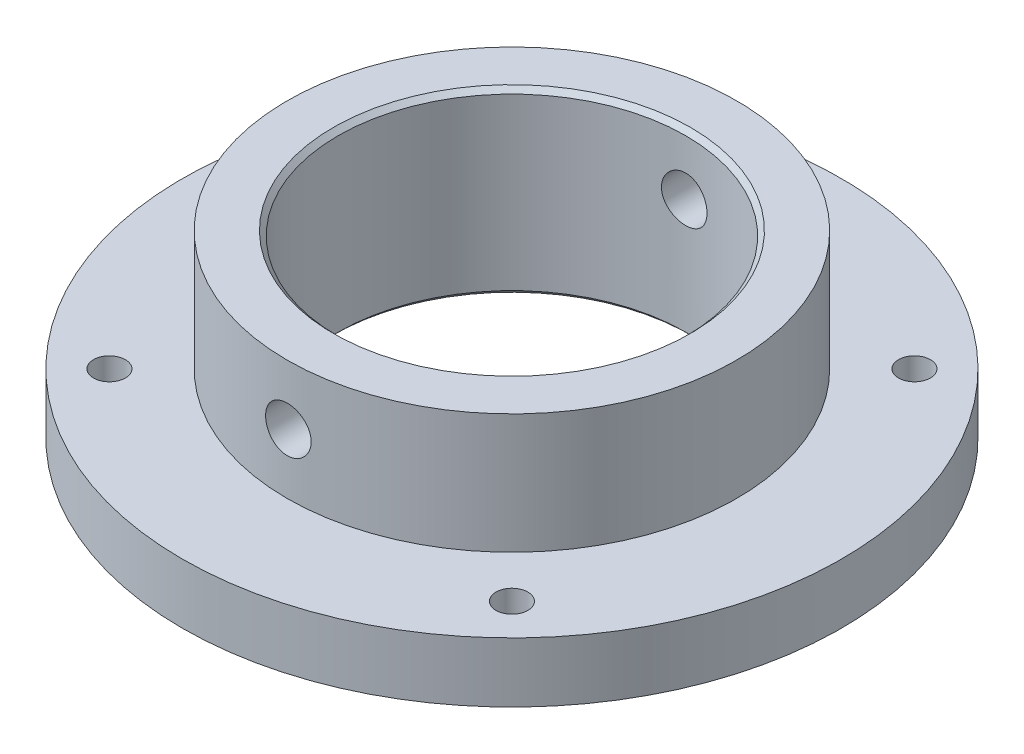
ISO-10303-21;
HEADER;
FILE_DESCRIPTION(('STEP AP214'),'2;1');
FILE_NAME('part.step','',(''),(''),'','','');
FILE_SCHEMA(('AUTOMOTIVE_DESIGN { 1 0 10303 214 1 1 1 1 }'));
ENDSEC;
DATA;
#1=APPLICATION_CONTEXT('core data for automotive mechanical design processes');
#2=APPLICATION_PROTOCOL_DEFINITION('international standard','automotive_design',2000,#1);
#3=PRODUCT_CONTEXT('',#1,'mechanical');
#4=PRODUCT('Part','Part','',(#3));
#5=PRODUCT_RELATED_PRODUCT_CATEGORY('part','',(#4));
#6=PRODUCT_DEFINITION_FORMATION('','',#4);
#7=PRODUCT_DEFINITION_CONTEXT('part definition',#1,'design');
#8=PRODUCT_DEFINITION('design','',#6,#7);
#9=PRODUCT_DEFINITION_SHAPE('','',#8);
#10=(LENGTH_UNIT() NAMED_UNIT(*) SI_UNIT(.MILLI.,.METRE.));
#11=(NAMED_UNIT(*) PLANE_ANGLE_UNIT() SI_UNIT($,.RADIAN.));
#12=(NAMED_UNIT(*) SI_UNIT($,.STERADIAN.) SOLID_ANGLE_UNIT());
#13=UNCERTAINTY_MEASURE_WITH_UNIT(LENGTH_MEASURE(1.E-05),#10,'distance_accuracy_value','');
#14=(GEOMETRIC_REPRESENTATION_CONTEXT(3) GLOBAL_UNCERTAINTY_ASSIGNED_CONTEXT((#13)) GLOBAL_UNIT_ASSIGNED_CONTEXT((#10,
#11,#12)) REPRESENTATION_CONTEXT('',''));
#15=CARTESIAN_POINT('',(0.,0.,0.));
#16=DIRECTION('',(0.,0.,1.));
#17=DIRECTION('',(1.,0.,0.));
#18=AXIS2_PLACEMENT_3D('',#15,#16,#17);
#19=CARTESIAN_POINT('',(0.,0.,0.));
#20=DIRECTION('',(0.,1.,0.));
#21=DIRECTION('',(0.,0.,1.));
#22=AXIS2_PLACEMENT_3D('',#19,#20,#21);
#23=CYLINDRICAL_SURFACE('',#22,36.83);
#24=CARTESIAN_POINT('',(0.,-17.526,36.83));
#25=CARTESIAN_POINT('',(0.134966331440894,-17.5260016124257,36.8300005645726));
#26=CARTESIAN_POINT('',(0.269909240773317,-17.5203362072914,36.8292566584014));
#27=CARTESIAN_POINT('',(0.538872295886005,-17.4977185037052,36.8263030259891));
#28=CARTESIAN_POINT('',(0.672892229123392,-17.4807636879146,36.8240929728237));
#29=CARTESIAN_POINT('',(0.93910394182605,-17.4356732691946,36.8182662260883));
#30=CARTESIAN_POINT('',(1.07129431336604,-17.4075295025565,36.8146485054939));
#31=CARTESIAN_POINT('',(1.33285927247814,-17.3402589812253,36.8061070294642));
#32=CARTESIAN_POINT('',(1.4622328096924,-17.3011282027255,36.8011827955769));
#33=CARTESIAN_POINT('',(1.71706269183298,-17.2122237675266,36.7901732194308));
#34=CARTESIAN_POINT('',(1.84252306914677,-17.1624615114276,36.7840891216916));
#35=CARTESIAN_POINT('',(2.08883921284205,-17.0526105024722,36.7709242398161));
#36=CARTESIAN_POINT('',(2.20969326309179,-16.9925179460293,36.763843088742));
#37=CARTESIAN_POINT('',(2.44584422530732,-16.8624849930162,36.7488875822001));
#38=CARTESIAN_POINT('',(2.56114410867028,-16.7925499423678,36.7410136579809));
#39=CARTESIAN_POINT('',(2.78550316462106,-16.6432740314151,36.7246855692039));
#40=CARTESIAN_POINT('',(2.89456000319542,-16.5639296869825,36.7162311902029));
#41=CARTESIAN_POINT('',(3.10616676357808,-16.3959898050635,36.6989367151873));
#42=CARTESIAN_POINT('',(3.20868130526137,-16.3073498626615,36.6900948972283));
#43=CARTESIAN_POINT('',(3.40592777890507,-16.1217361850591,36.6723106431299));
#44=CARTESIAN_POINT('',(3.50065681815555,-16.0247593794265,36.6633681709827));
#45=CARTESIAN_POINT('',(3.68160177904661,-15.8232066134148,36.645640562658));
#46=CARTESIAN_POINT('',(3.76782037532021,-15.7186330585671,36.6368553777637));
#47=CARTESIAN_POINT('',(3.93120420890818,-15.5025458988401,36.6196844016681));
#48=CARTESIAN_POINT('',(4.00836609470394,-15.3910297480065,36.6112987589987));
#49=CARTESIAN_POINT('',(4.15329605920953,-15.1614817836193,36.5951413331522));
#50=CARTESIAN_POINT('',(4.22103175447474,-15.0434293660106,36.5873717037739));
#51=CARTESIAN_POINT('',(4.34633563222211,-14.8019412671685,36.5726981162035));
#52=CARTESIAN_POINT('',(4.40390003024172,-14.6785036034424,36.5657944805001));
#53=CARTESIAN_POINT('',(4.50838812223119,-14.427197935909,36.5530589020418));
#54=CARTESIAN_POINT('',(4.55531609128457,-14.2993317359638,36.5472265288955));
#55=CARTESIAN_POINT('',(4.63822633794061,-14.0400358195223,36.5367961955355));
#56=CARTESIAN_POINT('',(4.67420459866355,-13.9086048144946,36.5321986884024));
#57=CARTESIAN_POINT('',(4.76487380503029,-13.5119905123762,36.5205255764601));
#58=CARTESIAN_POINT('',(4.8030187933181,-13.2427491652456,36.5154786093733));
#59=CARTESIAN_POINT('',(4.83360826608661,-12.7017900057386,36.5114412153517));
#60=CARTESIAN_POINT('',(4.82605476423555,-12.4300723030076,36.5124505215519));
#61=CARTESIAN_POINT('',(4.76573340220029,-11.8934950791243,36.5203722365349));
#62=CARTESIAN_POINT('',(4.71325000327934,-11.6286031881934,36.5272475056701));
#63=CARTESIAN_POINT('',(4.56498674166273,-11.1114293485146,36.546071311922));
#64=CARTESIAN_POINT('',(4.4692059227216,-10.8591476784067,36.5580199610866));
#65=CARTESIAN_POINT('',(4.23676737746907,-10.3734630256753,36.5856853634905));
#66=CARTESIAN_POINT('',(4.0999867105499,-10.1401195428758,36.6014134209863));
#67=CARTESIAN_POINT('',(3.78951787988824,-9.69959077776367,36.6348570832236));
#68=CARTESIAN_POINT('',(3.61582786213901,-9.4924068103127,36.6525727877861));
#69=CARTESIAN_POINT('',(3.23489750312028,-9.10842632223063,36.6881605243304));
#70=CARTESIAN_POINT('',(3.02741203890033,-8.93187290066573,36.7060327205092));
#71=CARTESIAN_POINT('',(2.58562251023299,-8.61606067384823,36.7397938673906));
#72=CARTESIAN_POINT('',(2.35131837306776,-8.47680196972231,36.7556828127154));
#73=CARTESIAN_POINT('',(1.86234985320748,-8.23952921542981,36.7836984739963));
#74=CARTESIAN_POINT('',(1.60767760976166,-8.14153118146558,36.7958237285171));
#75=CARTESIAN_POINT('',(1.0852978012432,-7.9897586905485,36.8149328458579));
#76=CARTESIAN_POINT('',(0.817590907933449,-7.93598195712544,36.8219169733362));
#77=CARTESIAN_POINT('',(0.27884210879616,-7.87449550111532,36.8299223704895));
#78=CARTESIAN_POINT('',(0.00783902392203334,-7.8664510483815,36.830986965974));
#79=CARTESIAN_POINT('',(-0.53165077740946,-7.89577300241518,36.8271505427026));
#80=CARTESIAN_POINT('',(-0.800137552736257,-7.93313834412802,36.8222496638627));
#81=CARTESIAN_POINT('',(-1.32597979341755,-8.05194105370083,36.8070598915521));
#82=CARTESIAN_POINT('',(-1.5833721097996,-8.13321803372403,36.796790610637));
#83=CARTESIAN_POINT('',(-2.08087401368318,-8.33736964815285,36.7720132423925));
#84=CARTESIAN_POINT('',(-2.32098296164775,-8.46024582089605,36.7575049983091));
#85=CARTESIAN_POINT('',(-2.77859210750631,-8.74491187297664,36.7257579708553));
#86=CARTESIAN_POINT('',(-2.99595714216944,-8.90691733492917,36.7085042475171));
#87=CARTESIAN_POINT('',(-3.40053111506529,-9.26494030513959,36.673241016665));
#88=CARTESIAN_POINT('',(-3.58773873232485,-9.46095930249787,36.6552314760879));
#89=CARTESIAN_POINT('',(-3.92787857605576,-9.88291955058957,36.6203517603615));
#90=CARTESIAN_POINT('',(-4.08058834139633,-10.1090408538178,36.6034894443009));
#91=CARTESIAN_POINT('',(-4.34585732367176,-10.5839306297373,36.5729453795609));
#92=CARTESIAN_POINT('',(-4.45841741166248,-10.8326986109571,36.5592635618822));
#93=CARTESIAN_POINT('',(-4.6398400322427,-11.3450636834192,36.5366823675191));
#94=CARTESIAN_POINT('',(-4.70882609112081,-11.6086165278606,36.5277694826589));
#95=CARTESIAN_POINT('',(-4.80152107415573,-12.1438396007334,36.5157031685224));
#96=CARTESIAN_POINT('',(-4.82523233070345,-12.4155094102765,36.5125494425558));
#97=CARTESIAN_POINT('',(-4.82635494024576,-12.8217918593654,36.5123962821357));
#98=CARTESIAN_POINT('',(-4.82106227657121,-12.9565711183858,36.5130983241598));
#99=CARTESIAN_POINT('',(-4.79922670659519,-13.2251858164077,36.515975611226));
#100=CARTESIAN_POINT('',(-4.78268799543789,-13.3590215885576,36.5181503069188));
#101=CARTESIAN_POINT('',(-4.73847046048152,-13.6248488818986,36.5239138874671));
#102=CARTESIAN_POINT('',(-4.71078759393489,-13.7568397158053,36.5275032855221));
#103=CARTESIAN_POINT('',(-4.64450177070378,-14.0179581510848,36.5359907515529));
#104=CARTESIAN_POINT('',(-4.60590278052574,-14.1470867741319,36.5408883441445));
#105=CARTESIAN_POINT('',(-4.51806654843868,-14.4016094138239,36.551852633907));
#106=CARTESIAN_POINT('',(-4.46883017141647,-14.5270037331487,36.5579192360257));
#107=CARTESIAN_POINT('',(-4.36009361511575,-14.7731512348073,36.5710470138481));
#108=CARTESIAN_POINT('',(-4.30059715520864,-14.8939060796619,36.5781078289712));
#109=CARTESIAN_POINT('',(-4.1717285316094,-15.1300317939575,36.5930292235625));
#110=CARTESIAN_POINT('',(-4.10235271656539,-15.2454006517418,36.6008900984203));
#111=CARTESIAN_POINT('',(-3.95425737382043,-15.4698733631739,36.617185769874));
#112=CARTESIAN_POINT('',(-3.87554119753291,-15.5789794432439,36.6256203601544));
#113=CARTESIAN_POINT('',(-3.70865097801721,-15.7910401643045,36.6428969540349));
#114=CARTESIAN_POINT('',(-3.62040869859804,-15.8939408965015,36.6517415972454));
#115=CARTESIAN_POINT('',(-3.43562240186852,-16.0919173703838,36.669524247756));
#116=CARTESIAN_POINT('',(-3.33908140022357,-16.1869959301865,36.6784622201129));
#117=CARTESIAN_POINT('',(-3.13828046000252,-16.3687631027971,36.6961886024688));
#118=CARTESIAN_POINT('',(-3.0340159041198,-16.4554466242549,36.7049769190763));
#119=CARTESIAN_POINT('',(-2.81858350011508,-16.6197200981,36.7221480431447));
#120=CARTESIAN_POINT('',(-2.70741821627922,-16.6973133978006,36.7305309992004));
#121=CARTESIAN_POINT('',(-2.47840060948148,-16.8432263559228,36.7466959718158));
#122=CARTESIAN_POINT('',(-2.36052012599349,-16.9115021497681,36.7544750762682));
#123=CARTESIAN_POINT('',(-2.11941300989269,-17.0378430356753,36.7691660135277));
#124=CARTESIAN_POINT('',(-1.99618836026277,-17.0959118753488,36.7760781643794));
#125=CARTESIAN_POINT('',(-1.74531846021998,-17.2014040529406,36.7888368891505));
#126=CARTESIAN_POINT('',(-1.617676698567,-17.2488355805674,36.7946842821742));
#127=CARTESIAN_POINT('',(-1.35883890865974,-17.3327470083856,36.805152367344));
#128=CARTESIAN_POINT('',(-1.22764371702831,-17.3692294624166,36.8097733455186));
#129=CARTESIAN_POINT('',(-0.915857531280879,-17.4418700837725,36.8190468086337));
#130=CARTESIAN_POINT('',(-0.734148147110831,-17.4733857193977,36.8231368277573));
#131=CARTESIAN_POINT('',(-0.368277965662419,-17.5154494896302,36.8286130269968));
#132=CARTESIAN_POINT('',(-0.18411718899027,-17.5259978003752,36.8299992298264));
#133=CARTESIAN_POINT('',(0.,-17.526,36.83));
#134=B_SPLINE_CURVE_WITH_KNOTS('',3,(#24,#25,#26,#27,#28,#29,#30,#31,#32,#33,#34,#35,#36,#37,
#38,#39,#40,#41,#42,#43,#44,#45,#46,#47,#48,#49,#50,#51,#52,#53,#54,#55,#56,#57,#58,#59,#60,#61,
#62,#63,#64,#65,#66,#67,#68,#69,#70,#71,#72,#73,#74,#75,#76,#77,#78,#79,#80,#81,#82,#83,#84,#85,
#86,#87,#88,#89,#90,#91,#92,#93,#94,#95,#96,#97,#98,#99,#100,#101,#102,#103,#104,#105,#106,#107,
#108,#109,#110,#111,#112,#113,#114,#115,#116,#117,#118,#119,#120,#121,#122,#123,#124,#125,#126,
#127,#128,#129,#130,#131,#132,#133),.UNSPECIFIED.,.T.,.F.,(4,2,2,2,2,2,2,2,2,2,2,2,2,2,2,2,2,2,
2,2,2,2,2,2,2,2,2,2,2,2,2,2,2,2,2,2,2,2,2,2,2,2,2,2,2,2,2,2,2,2,2,2,2,2,4),(0.,
0.404737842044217,0.80956596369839,1.21469000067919,1.61996260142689,2.02480277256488,
2.42979232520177,2.83456275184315,3.23948353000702,3.64643525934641,4.05353751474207,
4.46051141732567,4.86763545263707,5.27612533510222,5.68476688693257,6.09324390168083,
6.50187058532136,7.31354976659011,8.12519318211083,8.93173558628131,9.73829580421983,
10.5472991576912,11.356343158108,12.1715404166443,12.9867398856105,13.8022555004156,
14.617729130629,15.4272262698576,16.2367044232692,17.043245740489,17.8498168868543,
18.6609374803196,19.4720935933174,20.2883399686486,21.1045686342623,21.9184728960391,
22.7323352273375,23.1365965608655,23.54070717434,23.9449645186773,24.3490751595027,
24.7531529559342,25.1570845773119,25.5611658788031,25.965102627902,26.3721534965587,
26.7790570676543,27.1862058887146,27.5932043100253,28.0020571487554,28.4107595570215,
28.8191462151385,29.2274375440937,29.779573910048,30.3317056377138),.UNSPECIFIED.);
#135=CARTESIAN_POINT('',(0.,-17.526,36.83));
#136=VERTEX_POINT('',#135);
#137=EDGE_CURVE('E84',#136,#136,#134,.T.);
#138=ORIENTED_EDGE('',*,*,#137,.T.);
#139=EDGE_LOOP('',(#138));
#140=FACE_BOUND('',#139,.T.);
#141=CARTESIAN_POINT('',(4.826,-12.7,-36.5124447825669));
#142=CARTESIAN_POINT('',(4.82600161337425,-12.8349607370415,-36.5124441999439));
#143=CARTESIAN_POINT('',(4.82033667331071,-12.9698980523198,-36.5131945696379));
#144=CARTESIAN_POINT('',(4.79772087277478,-13.238849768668,-36.5161732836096));
#145=CARTESIAN_POINT('',(4.78076749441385,-13.3728639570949,-36.5184019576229));
#146=CARTESIAN_POINT('',(4.73568100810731,-13.6390640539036,-36.524276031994));
#147=CARTESIAN_POINT('',(4.70753972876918,-13.7712485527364,-36.5279224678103));
#148=CARTESIAN_POINT('',(4.64027534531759,-14.0328016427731,-36.5365282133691));
#149=CARTESIAN_POINT('',(4.60114821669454,-14.1621691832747,-36.5414880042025));
#150=CARTESIAN_POINT('',(4.51225259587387,-14.4169863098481,-36.5525714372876));
#151=CARTESIAN_POINT('',(4.46249557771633,-14.542439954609,-36.5586938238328));
#152=CARTESIAN_POINT('',(4.35265631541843,-14.788743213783,-36.5719338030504));
#153=CARTESIAN_POINT('',(4.29257026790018,-14.9095911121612,-36.579051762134));
#154=CARTESIAN_POINT('',(4.16255132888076,-15.1457308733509,-36.5940752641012));
#155=CARTESIAN_POINT('',(4.09262377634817,-15.2610257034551,-36.6019803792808));
#156=CARTESIAN_POINT('',(3.94336355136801,-15.4853760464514,-36.6183617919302));
#157=CARTESIAN_POINT('',(3.86402739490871,-15.5944292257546,-36.6268383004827));
#158=CARTESIAN_POINT('',(3.69609569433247,-15.8060410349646,-36.6441664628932));
#159=CARTESIAN_POINT('',(3.60745484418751,-15.9085635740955,-36.6530198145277));
#160=CARTESIAN_POINT('',(3.42183765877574,-16.1058261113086,-36.6708142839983));
#161=CARTESIAN_POINT('',(3.3248582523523,-16.2005632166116,-36.6797554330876));
#162=CARTESIAN_POINT('',(3.12329868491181,-16.3815239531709,-36.6974676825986));
#163=CARTESIAN_POINT('',(3.01872094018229,-16.4677502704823,-36.7062388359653));
#164=CARTESIAN_POINT('',(2.80262382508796,-16.6311489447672,-36.7233706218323));
#165=CARTESIAN_POINT('',(2.69110190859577,-16.7083179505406,-36.7317311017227));
#166=CARTESIAN_POINT('',(2.46154939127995,-16.8532559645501,-36.7478292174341));
#167=CARTESIAN_POINT('',(2.34349862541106,-16.9209932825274,-36.7555647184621));
#168=CARTESIAN_POINT('',(2.10201370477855,-17.0463005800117,-36.7701656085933));
#169=CARTESIAN_POINT('',(1.97857756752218,-17.1038667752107,-36.7770306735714));
#170=CARTESIAN_POINT('',(1.72727501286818,-17.2083585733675,-36.7896890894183));
#171=CARTESIAN_POINT('',(1.59941039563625,-17.2552884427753,-36.795482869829));
#172=CARTESIAN_POINT('',(1.34011797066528,-17.3382025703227,-36.8058403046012));
#173=CARTESIAN_POINT('',(1.20868887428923,-17.3741828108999,-36.810403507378));
#174=CARTESIAN_POINT('',(0.812083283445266,-17.4648576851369,-36.8219867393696));
#175=CARTESIAN_POINT('',(0.542849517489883,-17.5030070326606,-36.8269906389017));
#176=CARTESIAN_POINT('',(0.00190523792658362,-17.5336078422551,-36.8309949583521));
#177=CARTESIAN_POINT('',(-0.269805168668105,-17.5260612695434,-36.8299956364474));
#178=CARTESIAN_POINT('',(-0.806412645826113,-17.4657509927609,-36.8221418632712));
#179=CARTESIAN_POINT('',(-1.07134127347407,-17.4132647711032,-36.8153233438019));
#180=CARTESIAN_POINT('',(-1.58858712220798,-17.2649831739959,-36.7966347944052));
#181=CARTESIAN_POINT('',(-1.84090408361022,-17.1691869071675,-36.7847646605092));
#182=CARTESIAN_POINT('',(-2.32663196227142,-16.9367161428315,-36.7572454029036));
#183=CARTESIAN_POINT('',(-2.55998510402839,-16.7999222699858,-36.7415852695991));
#184=CARTESIAN_POINT('',(-3.0005276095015,-16.4894251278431,-36.7082363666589));
#185=CARTESIAN_POINT('',(-3.20771565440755,-16.3157199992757,-36.6905474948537));
#186=CARTESIAN_POINT('',(-3.5916795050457,-15.9347787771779,-36.6549624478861));
#187=CARTESIAN_POINT('',(-3.76821524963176,-15.7273006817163,-36.6370657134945));
#188=CARTESIAN_POINT('',(-4.08399530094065,-15.2855322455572,-36.6032127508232));
#189=CARTESIAN_POINT('',(-4.22323946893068,-15.0512418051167,-36.5872565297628));
#190=CARTESIAN_POINT('',(-4.46050170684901,-14.56227729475,-36.5590915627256));
#191=CARTESIAN_POINT('',(-4.55849932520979,-14.307593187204,-36.5468846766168));
#192=CARTESIAN_POINT('',(-4.71026736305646,-13.7851875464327,-36.527635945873));
#193=CARTESIAN_POINT('',(-4.76404013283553,-13.5174667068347,-36.5205938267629));
#194=CARTESIAN_POINT('',(-4.82551160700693,-12.9787109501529,-36.5125226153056));
#195=CARTESIAN_POINT('',(-4.83354870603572,-12.707715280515,-36.5114493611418));
#196=CARTESIAN_POINT('',(-4.80421469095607,-12.1682420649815,-36.5153205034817));
#197=CARTESIAN_POINT('',(-4.76684464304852,-11.8997644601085,-36.5202647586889));
#198=CARTESIAN_POINT('',(-4.64804254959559,-11.3739702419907,-36.5355734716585));
#199=CARTESIAN_POINT('',(-4.56677542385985,-11.1166157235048,-36.5459176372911));
#200=CARTESIAN_POINT('',(-4.36265614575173,-10.6191850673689,-36.5708441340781));
#201=CARTESIAN_POINT('',(-4.23980239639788,-10.3791095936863,-36.5854266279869));
#202=CARTESIAN_POINT('',(-3.95516977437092,-9.92152401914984,-36.6172921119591));
#203=CARTESIAN_POINT('',(-3.79316963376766,-9.70415262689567,-36.6345902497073));
#204=CARTESIAN_POINT('',(-3.43515346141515,-9.2995633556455,-36.669890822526));
#205=CARTESIAN_POINT('',(-3.23913597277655,-9.11234676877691,-36.6878932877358));
#206=CARTESIAN_POINT('',(-2.81717197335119,-8.77218644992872,-36.7227104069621));
#207=CARTESIAN_POINT('',(-2.59104510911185,-8.61946550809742,-36.739516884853));
#208=CARTESIAN_POINT('',(-2.11614112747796,-8.35417693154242,-36.7699246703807));
#209=CARTESIAN_POINT('',(-1.86736450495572,-8.24160841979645,-36.7835260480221));
#210=CARTESIAN_POINT('',(-1.3550040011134,-8.06018046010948,-36.8059565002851));
#211=CARTESIAN_POINT('',(-1.09146566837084,-7.99119383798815,-36.8147994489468));
#212=CARTESIAN_POINT('',(-0.55627332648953,-7.89849280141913,-36.8267686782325));
#213=CARTESIAN_POINT('',(-0.284619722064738,-7.87477613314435,-36.8298952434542));
#214=CARTESIAN_POINT('',(0.121659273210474,-7.8736413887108,-36.8300485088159));
#215=CARTESIAN_POINT('',(0.256450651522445,-7.87893097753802,-36.8293530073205));
#216=CARTESIAN_POINT('',(0.525089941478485,-7.90076246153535,-36.8265007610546));
#217=CARTESIAN_POINT('',(0.65893818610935,-7.91730016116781,-36.8243445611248));
#218=CARTESIAN_POINT('',(0.92479062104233,-7.96151781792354,-36.8186279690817));
#219=CARTESIAN_POINT('',(1.05679412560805,-7.98920181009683,-36.8150670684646));
#220=CARTESIAN_POINT('',(1.31793794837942,-8.05549212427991,-36.8066433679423));
#221=CARTESIAN_POINT('',(1.44707928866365,-8.09409447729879,-36.8017810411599));
#222=CARTESIAN_POINT('',(1.70162850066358,-8.18194019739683,-36.7908900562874));
#223=CARTESIAN_POINT('',(1.82703663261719,-8.23118282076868,-36.7848614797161));
#224=CARTESIAN_POINT('',(2.07321080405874,-8.33993424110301,-36.7718083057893));
#225=CARTESIAN_POINT('',(2.19397850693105,-8.39943931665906,-36.7647840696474));
#226=CARTESIAN_POINT('',(2.43012835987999,-8.52832723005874,-36.7499303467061));
#227=CARTESIAN_POINT('',(2.54550850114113,-8.59771371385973,-36.74210056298));
#228=CARTESIAN_POINT('',(2.77000175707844,-8.74583206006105,-36.7258581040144));
#229=CARTESIAN_POINT('',(2.87911709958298,-8.82456056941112,-36.7174456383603));
#230=CARTESIAN_POINT('',(3.09117783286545,-8.99146399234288,-36.7002033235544));
#231=CARTESIAN_POINT('',(3.19407037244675,-9.07970578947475,-36.6913708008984));
#232=CARTESIAN_POINT('',(3.39203035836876,-9.26448942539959,-36.6735995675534));
#233=CARTESIAN_POINT('',(3.48710062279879,-9.36102824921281,-36.6646608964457));
#234=CARTESIAN_POINT('',(3.66885148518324,-9.56182319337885,-36.6469203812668));
#235=CARTESIAN_POINT('',(3.7555269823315,-9.66608393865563,-36.6381186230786));
#236=CARTESIAN_POINT('',(3.91978497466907,-9.88150712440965,-36.6209093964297));
#237=CARTESIAN_POINT('',(3.99737081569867,-9.99266700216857,-36.6125017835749));
#238=CARTESIAN_POINT('',(4.14327489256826,-10.221680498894,-36.5962783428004));
#239=CARTESIAN_POINT('',(4.21154859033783,-10.3395627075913,-36.5884654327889));
#240=CARTESIAN_POINT('',(4.33788511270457,-10.580673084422,-36.5737022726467));
#241=CARTESIAN_POINT('',(4.39595168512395,-10.7038992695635,-36.5667517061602));
#242=CARTESIAN_POINT('',(4.50143921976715,-10.9547722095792,-36.553915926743));
#243=CARTESIAN_POINT('',(4.54886838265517,-11.0824154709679,-36.5480298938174));
#244=CARTESIAN_POINT('',(4.63277502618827,-11.341256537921,-36.5374886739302));
#245=CARTESIAN_POINT('',(4.6692550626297,-11.4724535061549,-36.532833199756));
#246=CARTESIAN_POINT('',(4.74188539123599,-11.784225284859,-36.5234887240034));
#247=CARTESIAN_POINT('',(4.77339526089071,-11.9659181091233,-36.5193652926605));
#248=CARTESIAN_POINT('',(4.81545137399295,-12.3317551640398,-36.5138437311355));
#249=CARTESIAN_POINT('',(4.82599779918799,-12.5158993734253,-36.512445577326));
#250=CARTESIAN_POINT('',(4.826,-12.7,-36.5124447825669));
#251=B_SPLINE_CURVE_WITH_KNOTS('',3,(#141,#142,#143,#144,#145,#146,#147,#148,#149,#150,#151,
#152,#153,#154,#155,#156,#157,#158,#159,#160,#161,#162,#163,#164,#165,#166,#167,#168,#169,#170,
#171,#172,#173,#174,#175,#176,#177,#178,#179,#180,#181,#182,#183,#184,#185,#186,#187,#188,#189,
#190,#191,#192,#193,#194,#195,#196,#197,#198,#199,#200,#201,#202,#203,#204,#205,#206,#207,#208,
#209,#210,#211,#212,#213,#214,#215,#216,#217,#218,#219,#220,#221,#222,#223,#224,#225,#226,#227,
#228,#229,#230,#231,#232,#233,#234,#235,#236,#237,#238,#239,#240,#241,#242,#243,#244,#245,#246,
#247,#248,#249,#250),.UNSPECIFIED.,.T.,.F.,(4,2,2,2,2,2,2,2,2,2,2,2,2,2,2,2,2,2,2,2,2,2,2,2,2,2,
2,2,2,2,2,2,2,2,2,2,2,2,2,2,2,2,2,2,2,2,2,2,2,2,2,2,2,2,4),(0.,0.404721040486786,
0.80953238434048,1.21463993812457,1.61989609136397,2.02471699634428,2.42968728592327,
2.83443872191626,3.23934050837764,3.64631432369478,4.05343867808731,4.46043412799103,
4.8675796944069,5.2760618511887,5.68469567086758,6.09316528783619,6.50178459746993,
7.31344199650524,8.12506448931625,8.93171141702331,9.73837494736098,10.5474104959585,
11.3564868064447,12.1716387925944,12.9867938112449,13.8023525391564,14.6178679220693,
15.4273414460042,16.2367959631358,17.0432303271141,17.8496956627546,18.660830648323,
19.472000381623,20.288268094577,21.1045179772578,21.9183748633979,22.7321912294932,
23.1364884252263,23.5406349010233,23.9449278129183,24.3490739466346,24.7531918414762,
25.1571635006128,25.5612846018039,25.9652610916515,26.3722900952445,26.7791718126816,
27.1862992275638,27.5932763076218,28.0021363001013,28.41084585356,28.8192392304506,
29.2275372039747,29.7796240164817,30.331706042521),.UNSPECIFIED.);
#252=CARTESIAN_POINT('',(4.826,-12.7,-36.5124447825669));
#253=VERTEX_POINT('',#252);
#254=EDGE_CURVE('E79',#253,#253,#251,.T.);
#255=ORIENTED_EDGE('',*,*,#254,.T.);
#256=EDGE_LOOP('',(#255));
#257=FACE_BOUND('',#256,.T.);
#258=CARTESIAN_POINT('',(0.,-1.01600000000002,0.));
#259=DIRECTION('',(0.,-1.,0.));
#260=DIRECTION('',(0.,0.,-1.));
#261=AXIS2_PLACEMENT_3D('',#258,#259,#260);
#262=CIRCLE('',#261,36.83);
#263=CARTESIAN_POINT('',(0.,-1.01600000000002,-36.83));
#264=VERTEX_POINT('',#263);
#265=EDGE_CURVE('E43',#264,#264,#262,.F.);
#266=ORIENTED_EDGE('',*,*,#265,.T.);
#267=EDGE_LOOP('',(#266));
#268=FACE_BOUND('',#267,.T.);
#269=CARTESIAN_POINT('',(0.,-37.084,0.));
#270=DIRECTION('',(0.,1.,0.));
#271=DIRECTION('',(0.,0.,1.));
#272=AXIS2_PLACEMENT_3D('',#269,#270,#271);
#273=CIRCLE('',#272,36.83);
#274=CARTESIAN_POINT('',(0.,-37.084,36.83));
#275=VERTEX_POINT('',#274);
#276=EDGE_CURVE('E103',#275,#275,#273,.F.);
#277=ORIENTED_EDGE('',*,*,#276,.T.);
#278=EDGE_LOOP('',(#277));
#279=FACE_BOUND('',#278,.T.);
#280=ADVANCED_FACE('F30',(#140,#257,#268,#279),#23,.F.);
#281=CARTESIAN_POINT('',(69.85,-38.1,0.));
#282=DIRECTION('',(0.,1.,0.));
#283=DIRECTION('',(0.,0.,1.));
#284=AXIS2_PLACEMENT_3D('',#281,#282,#283);
#285=PLANE('',#284);
#286=CARTESIAN_POINT('',(-42.6562165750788,-38.1,42.6562165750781));
#287=DIRECTION('',(0.,1.,0.));
#288=DIRECTION('',(1.,0.,0.));
#289=AXIS2_PLACEMENT_3D('',#286,#287,#288);
#290=CIRCLE('',#289,3.3782);
#291=CARTESIAN_POINT('',(-42.6562165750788,-38.1,46.0344165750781));
#292=VERTEX_POINT('',#291);
#293=EDGE_CURVE('E251',#292,#292,#290,.T.);
#294=ORIENTED_EDGE('',*,*,#293,.T.);
#295=EDGE_LOOP('',(#294));
#296=FACE_BOUND('',#295,.T.);
#297=CARTESIAN_POINT('',(42.6562165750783,-38.1,42.6562165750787));
#298=DIRECTION('',(0.,1.,0.));
#299=DIRECTION('',(0.,0.,-1.));
#300=AXIS2_PLACEMENT_3D('',#297,#298,#299);
#301=CIRCLE('',#300,3.3782);
#302=CARTESIAN_POINT('',(42.6562165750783,-38.1,46.0344165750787));
#303=VERTEX_POINT('',#302);
#304=EDGE_CURVE('E254',#303,#303,#301,.T.);
#305=ORIENTED_EDGE('',*,*,#304,.T.);
#306=EDGE_LOOP('',(#305));
#307=FACE_BOUND('',#306,.T.);
#308=CARTESIAN_POINT('',(42.6562165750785,-38.1,-42.6562165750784));
#309=DIRECTION('',(0.,1.,0.));
#310=DIRECTION('',(-1.,0.,0.));
#311=AXIS2_PLACEMENT_3D('',#308,#309,#310);
#312=CIRCLE('',#311,3.3782);
#313=CARTESIAN_POINT('',(42.6562165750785,-38.1,-39.2780165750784));
#314=VERTEX_POINT('',#313);
#315=EDGE_CURVE('E259',#314,#314,#312,.T.);
#316=ORIENTED_EDGE('',*,*,#315,.T.);
#317=EDGE_LOOP('',(#316));
#318=FACE_BOUND('',#317,.T.);
#319=CARTESIAN_POINT('',(-42.6562165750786,-38.1,-42.6562165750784));
#320=DIRECTION('',(0.,1.,0.));
#321=DIRECTION('',(0.,0.,1.));
#322=AXIS2_PLACEMENT_3D('',#319,#320,#321);
#323=CIRCLE('',#322,3.3782);
#324=CARTESIAN_POINT('',(-42.6562165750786,-38.1,-39.2780165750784));
#325=VERTEX_POINT('',#324);
#326=EDGE_CURVE('E85',#325,#325,#323,.T.);
#327=ORIENTED_EDGE('',*,*,#326,.T.);
#328=EDGE_LOOP('',(#327));
#329=FACE_BOUND('',#328,.T.);
#330=CARTESIAN_POINT('',(0.,-38.1,0.));
#331=DIRECTION('',(0.,1.,0.));
#332=DIRECTION('',(0.,0.,1.));
#333=AXIS2_PLACEMENT_3D('',#330,#331,#332);
#334=CIRCLE('',#333,37.846);
#335=CARTESIAN_POINT('',(0.,-38.1,37.846));
#336=VERTEX_POINT('',#335);
#337=EDGE_CURVE('E10',#336,#336,#334,.T.);
#338=ORIENTED_EDGE('',*,*,#337,.T.);
#339=EDGE_LOOP('',(#338));
#340=FACE_BOUND('',#339,.T.);
#341=CARTESIAN_POINT('',(0.,-38.1,0.));
#342=DIRECTION('',(0.,1.,0.));
#343=DIRECTION('',(0.,0.,1.));
#344=AXIS2_PLACEMENT_3D('',#341,#342,#343);
#345=CIRCLE('',#344,69.85);
#346=CARTESIAN_POINT('',(0.,-38.1,69.85));
#347=VERTEX_POINT('',#346);
#348=EDGE_CURVE('E100',#347,#347,#345,.T.);
#349=ORIENTED_EDGE('',*,*,#348,.F.);
#350=EDGE_LOOP('',(#349));
#351=FACE_BOUND('',#350,.T.);
#352=ADVANCED_FACE('F122',(#296,#307,#318,#329,#340,#351),#285,.F.);
#353=CARTESIAN_POINT('',(0.,0.,0.));
#354=DIRECTION('',(0.,1.,0.));
#355=DIRECTION('',(0.,0.,1.));
#356=AXIS2_PLACEMENT_3D('',#353,#354,#355);
#357=CYLINDRICAL_SURFACE('',#356,69.85);
#358=CARTESIAN_POINT('',(0.,-25.4,0.));
#359=DIRECTION('',(0.,1.,0.));
#360=DIRECTION('',(0.,0.,1.));
#361=AXIS2_PLACEMENT_3D('',#358,#359,#360);
#362=CIRCLE('',#361,69.85);
#363=CARTESIAN_POINT('',(0.,-25.4,69.85));
#364=VERTEX_POINT('',#363);
#365=EDGE_CURVE('E97',#364,#364,#362,.T.);
#366=ORIENTED_EDGE('',*,*,#365,.F.);
#367=EDGE_LOOP('',(#366));
#368=FACE_BOUND('',#367,.T.);
#369=ORIENTED_EDGE('',*,*,#348,.T.);
#370=EDGE_LOOP('',(#369));
#371=FACE_BOUND('',#370,.T.);
#372=ADVANCED_FACE('F127',(#368,#371),#357,.T.);
#373=CARTESIAN_POINT('',(47.625,-25.4,0.));
#374=DIRECTION('',(0.,-1.,0.));
#375=DIRECTION('',(0.,0.,-1.));
#376=AXIS2_PLACEMENT_3D('',#373,#374,#375);
#377=PLANE('',#376);
#378=CARTESIAN_POINT('',(-42.6562165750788,-25.4,42.6562165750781));
#379=DIRECTION('',(0.,-1.,0.));
#380=DIRECTION('',(0.,0.,-1.));
#381=AXIS2_PLACEMENT_3D('',#378,#379,#380);
#382=CIRCLE('',#381,3.3782);
#383=CARTESIAN_POINT('',(-42.6562165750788,-25.4,46.0344165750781));
#384=VERTEX_POINT('',#383);
#385=EDGE_CURVE('E34',#384,#384,#382,.T.);
#386=ORIENTED_EDGE('',*,*,#385,.T.);
#387=EDGE_LOOP('',(#386));
#388=FACE_BOUND('',#387,.T.);
#389=CARTESIAN_POINT('',(42.6562165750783,-25.4,42.6562165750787));
#390=DIRECTION('',(0.,-1.,0.));
#391=DIRECTION('',(0.,0.,-1.));
#392=AXIS2_PLACEMENT_3D('',#389,#390,#391);
#393=CIRCLE('',#392,3.3782);
#394=CARTESIAN_POINT('',(42.6562165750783,-25.4,46.0344165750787));
#395=VERTEX_POINT('',#394);
#396=EDGE_CURVE('E256',#395,#395,#393,.T.);
#397=ORIENTED_EDGE('',*,*,#396,.T.);
#398=EDGE_LOOP('',(#397));
#399=FACE_BOUND('',#398,.T.);
#400=CARTESIAN_POINT('',(42.6562165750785,-25.4,-42.6562165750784));
#401=DIRECTION('',(0.,-1.,0.));
#402=DIRECTION('',(0.,0.,-1.));
#403=AXIS2_PLACEMENT_3D('',#400,#401,#402);
#404=CIRCLE('',#403,3.3782);
#405=CARTESIAN_POINT('',(42.6562165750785,-25.4,-39.2780165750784));
#406=VERTEX_POINT('',#405);
#407=EDGE_CURVE('E261',#406,#406,#404,.T.);
#408=ORIENTED_EDGE('',*,*,#407,.T.);
#409=EDGE_LOOP('',(#408));
#410=FACE_BOUND('',#409,.T.);
#411=CARTESIAN_POINT('',(-42.6562165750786,-25.4,-42.6562165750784));
#412=DIRECTION('',(0.,-1.,0.));
#413=DIRECTION('',(0.,0.,-1.));
#414=AXIS2_PLACEMENT_3D('',#411,#412,#413);
#415=CIRCLE('',#414,3.3782);
#416=CARTESIAN_POINT('',(-42.6562165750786,-25.4,-39.2780165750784));
#417=VERTEX_POINT('',#416);
#418=EDGE_CURVE('E55',#417,#417,#415,.T.);
#419=ORIENTED_EDGE('',*,*,#418,.T.);
#420=EDGE_LOOP('',(#419));
#421=FACE_BOUND('',#420,.T.);
#422=CARTESIAN_POINT('',(0.,-25.4,0.));
#423=DIRECTION('',(0.,1.,0.));
#424=DIRECTION('',(0.,0.,1.));
#425=AXIS2_PLACEMENT_3D('',#422,#423,#424);
#426=CIRCLE('',#425,47.625);
#427=CARTESIAN_POINT('',(0.,-25.4,47.625));
#428=VERTEX_POINT('',#427);
#429=EDGE_CURVE('E94',#428,#428,#426,.T.);
#430=ORIENTED_EDGE('',*,*,#429,.F.);
#431=EDGE_LOOP('',(#430));
#432=FACE_BOUND('',#431,.T.);
#433=ORIENTED_EDGE('',*,*,#365,.T.);
#434=EDGE_LOOP('',(#433));
#435=FACE_BOUND('',#434,.T.);
#436=ADVANCED_FACE('F141',(#388,#399,#410,#421,#432,#435),#377,.F.);
#437=CARTESIAN_POINT('',(0.,0.,0.));
#438=DIRECTION('',(0.,1.,0.));
#439=DIRECTION('',(0.,0.,1.));
#440=AXIS2_PLACEMENT_3D('',#437,#438,#439);
#441=CYLINDRICAL_SURFACE('',#440,47.625);
#442=CARTESIAN_POINT('',(0.,-17.526,47.625));
#443=CARTESIAN_POINT('',(-0.135215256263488,-17.5260013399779,47.6250003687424));
#444=CARTESIAN_POINT('',(-0.270410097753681,-17.5203151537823,47.6244229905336));
#445=CARTESIAN_POINT('',(-0.539878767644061,-17.4976126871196,47.622130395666));
#446=CARTESIAN_POINT('',(-0.674152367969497,-17.4805936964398,47.6204149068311));
#447=CARTESIAN_POINT('',(-0.940881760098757,-17.4353281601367,47.6158920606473));
#448=CARTESIAN_POINT('',(-1.0733360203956,-17.4070726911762,47.613083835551));
#449=CARTESIAN_POINT('',(-1.33542733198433,-17.3395289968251,47.6064538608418));
#450=CARTESIAN_POINT('',(-1.46506333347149,-17.300236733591,47.6026317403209));
#451=CARTESIAN_POINT('',(-1.72042302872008,-17.2109531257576,47.5940865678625));
#452=CARTESIAN_POINT('',(-1.84615042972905,-17.1609722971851,47.5893644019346));
#453=CARTESIAN_POINT('',(-2.09298641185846,-17.0506282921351,47.5791477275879));
#454=CARTESIAN_POINT('',(-2.21409327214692,-16.9902612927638,47.5736529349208));
#455=CARTESIAN_POINT('',(-2.45072204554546,-16.8596264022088,47.5620501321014));
#456=CARTESIAN_POINT('',(-2.56624710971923,-16.7893641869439,47.5559424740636));
#457=CARTESIAN_POINT('',(-2.7910216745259,-16.6393826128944,47.5432802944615));
#458=CARTESIAN_POINT('',(-2.90026883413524,-16.5596597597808,47.5367256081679));
#459=CARTESIAN_POINT('',(-3.11198826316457,-16.3910931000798,47.5233357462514));
#460=CARTESIAN_POINT('',(-3.21443986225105,-16.3022233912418,47.5164998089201));
#461=CARTESIAN_POINT('',(-3.41153698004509,-16.1161478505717,47.5027557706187));
#462=CARTESIAN_POINT('',(-3.50617959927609,-16.018938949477,47.4958476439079));
#463=CARTESIAN_POINT('',(-3.68692259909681,-15.8169281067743,47.4821591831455));
#464=CARTESIAN_POINT('',(-3.77302571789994,-15.7121286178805,47.4753788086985));
#465=CARTESIAN_POINT('',(-3.93614742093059,-15.4956036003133,47.4621330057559));
#466=CARTESIAN_POINT('',(-4.01316264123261,-15.3838755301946,47.4556676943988));
#467=CARTESIAN_POINT('',(-4.15765646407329,-15.1541025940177,47.4432270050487));
#468=CARTESIAN_POINT('',(-4.22511748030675,-15.0360466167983,47.4372525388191));
#469=CARTESIAN_POINT('',(-4.34987529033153,-14.794597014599,47.4259753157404));
#470=CARTESIAN_POINT('',(-4.4071683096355,-14.6712014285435,47.4206728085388));
#471=CARTESIAN_POINT('',(-4.51112471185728,-14.4200251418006,47.4108965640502));
#472=CARTESIAN_POINT('',(-4.55779222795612,-14.2922461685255,47.4064225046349));
#473=CARTESIAN_POINT('',(-4.64019944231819,-14.0331688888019,47.3984267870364));
#474=CARTESIAN_POINT('',(-4.6759351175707,-13.9018693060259,47.394905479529));
#475=CARTESIAN_POINT('',(-4.76605605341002,-13.5050999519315,47.3859597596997));
#476=CARTESIAN_POINT('',(-4.80383081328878,-13.2356068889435,47.3821072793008));
#477=CARTESIAN_POINT('',(-4.83361593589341,-12.6942271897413,47.3790773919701));
#478=CARTESIAN_POINT('',(-4.82562753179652,-12.4223406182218,47.3798998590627));
#479=CARTESIAN_POINT('',(-4.76430051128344,-11.8847799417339,47.3861055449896));
#480=CARTESIAN_POINT('',(-4.71113091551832,-11.6190864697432,47.391471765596));
#481=CARTESIAN_POINT('',(-4.56119785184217,-11.1004241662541,47.4061359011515));
#482=CARTESIAN_POINT('',(-4.464433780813,-10.847455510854,47.4154338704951));
#483=CARTESIAN_POINT('',(-4.22987643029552,-10.3608772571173,47.4369328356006));
#484=CARTESIAN_POINT('',(-4.0920082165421,-10.1273040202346,47.449139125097));
#485=CARTESIAN_POINT('',(-3.77920884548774,-9.68654829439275,47.4750750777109));
#486=CARTESIAN_POINT('',(-3.60427657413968,-9.47936659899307,47.4888047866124));
#487=CARTESIAN_POINT('',(-3.22137114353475,-9.09629176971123,47.5163163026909));
#488=CARTESIAN_POINT('',(-3.01325198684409,-8.92054453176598,47.5300980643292));
#489=CARTESIAN_POINT('',(-2.57038720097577,-8.60645874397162,47.5561021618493));
#490=CARTESIAN_POINT('',(-2.33564154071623,-8.46812023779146,47.5683244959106));
#491=CARTESIAN_POINT('',(-1.84608570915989,-8.2327843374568,47.589836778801));
#492=CARTESIAN_POINT('',(-1.59127191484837,-8.13579442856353,47.5991261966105));
#493=CARTESIAN_POINT('',(-1.06886106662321,-7.98601628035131,47.6137205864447));
#494=CARTESIAN_POINT('',(-0.801264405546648,-7.93322668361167,47.6190256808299));
#495=CARTESIAN_POINT('',(-0.262147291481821,-7.87353293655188,47.6250379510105));
#496=CARTESIAN_POINT('',(0.00935065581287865,-7.86642747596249,47.6257652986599));
#497=CARTESIAN_POINT('',(0.549672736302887,-7.89777484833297,47.6225942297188));
#498=CARTESIAN_POINT('',(0.818496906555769,-7.93622704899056,47.618695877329));
#499=CARTESIAN_POINT('',(1.34525884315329,-8.05743118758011,47.60672436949));
#500=CARTESIAN_POINT('',(1.60321853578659,-8.14008878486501,47.5986601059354));
#501=CARTESIAN_POINT('',(2.10161075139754,-8.34726043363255,47.5792613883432));
#502=CARTESIAN_POINT('',(2.34204287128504,-8.47177544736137,47.5679268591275));
#503=CARTESIAN_POINT('',(2.79946463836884,-8.75962581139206,47.5432049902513));
#504=CARTESIAN_POINT('',(3.01637073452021,-8.92309332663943,47.5298107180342));
#505=CARTESIAN_POINT('',(3.41973723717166,-9.28402003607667,47.5024943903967));
#506=CARTESIAN_POINT('',(3.60619685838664,-9.4814801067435,47.4885723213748));
#507=CARTESIAN_POINT('',(3.94407757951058,-9.90566192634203,47.4617086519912));
#508=CARTESIAN_POINT('',(4.09536649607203,-10.1324892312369,47.4487708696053));
#509=CARTESIAN_POINT('',(4.35770098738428,-10.6084599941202,47.4253992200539));
#510=CARTESIAN_POINT('',(4.46874712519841,-10.8576031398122,47.4149653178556));
#511=CARTESIAN_POINT('',(4.64722804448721,-11.3706306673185,47.3978054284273));
#512=CARTESIAN_POINT('',(4.71474127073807,-11.6344875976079,47.3910727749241));
#513=CARTESIAN_POINT('',(4.80447530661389,-12.1700125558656,47.382061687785));
#514=CARTESIAN_POINT('',(4.82669745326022,-12.4416803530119,47.3797831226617));
#515=CARTESIAN_POINT('',(4.82562622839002,-12.8481970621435,47.3798885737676));
#516=CARTESIAN_POINT('',(4.81957529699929,-12.9833044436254,47.3805068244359));
#517=CARTESIAN_POINT('',(4.79616772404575,-13.252512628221,47.3828826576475));
#518=CARTESIAN_POINT('',(4.77881527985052,-13.3866137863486,47.3846398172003));
#519=CARTESIAN_POINT('',(4.73291804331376,-13.6529084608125,47.3892459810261));
#520=CARTESIAN_POINT('',(4.70436915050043,-13.7851012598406,47.392095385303));
#521=CARTESIAN_POINT('',(4.63630238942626,-14.0465564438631,47.3988026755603));
#522=CARTESIAN_POINT('',(4.59678853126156,-14.1758198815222,47.4026601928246));
#523=CARTESIAN_POINT('',(4.50706314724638,-14.4305781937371,47.4112754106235));
#524=CARTESIAN_POINT('',(4.45684933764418,-14.5560722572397,47.416033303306));
#525=CARTESIAN_POINT('',(4.34611025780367,-14.8023373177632,47.4263116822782));
#526=CARTESIAN_POINT('',(4.28558875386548,-14.9231100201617,47.4318318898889));
#527=CARTESIAN_POINT('',(4.1546291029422,-15.159178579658,47.4434821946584));
#528=CARTESIAN_POINT('',(4.08418744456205,-15.2744724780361,47.4496125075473));
#529=CARTESIAN_POINT('',(3.93392899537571,-15.4986935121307,47.4623061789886));
#530=CARTESIAN_POINT('',(3.85411561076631,-15.6076229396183,47.4688693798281));
#531=CARTESIAN_POINT('',(3.6852538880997,-15.8189027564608,47.4822780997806));
#532=CARTESIAN_POINT('',(3.59616364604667,-15.9212195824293,47.4891248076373));
#533=CARTESIAN_POINT('',(3.40972480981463,-16.1179543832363,47.5028749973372));
#534=CARTESIAN_POINT('',(3.31237924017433,-16.2123752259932,47.5097784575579));
#535=CARTESIAN_POINT('',(3.11002266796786,-16.392751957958,47.5234539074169));
#536=CARTESIAN_POINT('',(3.00500704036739,-16.4787026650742,47.5302258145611));
#537=CARTESIAN_POINT('',(2.78813960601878,-16.6414369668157,47.54344010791));
#538=CARTESIAN_POINT('',(2.67629033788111,-16.7182239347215,47.5498826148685));
#539=CARTESIAN_POINT('',(2.4461650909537,-16.8623356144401,47.5622772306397));
#540=CARTESIAN_POINT('',(2.32787109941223,-16.9296316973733,47.5682278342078));
#541=CARTESIAN_POINT('',(2.08604292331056,-17.0539844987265,47.5794461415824));
#542=CARTESIAN_POINT('',(1.96251067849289,-17.1110449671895,47.5847140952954));
#543=CARTESIAN_POINT('',(1.71114216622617,-17.214501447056,47.5944158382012));
#544=CARTESIAN_POINT('',(1.58330951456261,-17.2609061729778,47.5988503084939));
#545=CARTESIAN_POINT('',(1.3242002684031,-17.3427610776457,47.6067634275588));
#546=CARTESIAN_POINT('',(1.19292452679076,-17.3782139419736,47.610242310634));
#547=CARTESIAN_POINT('',(0.886578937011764,-17.4472062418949,47.6170638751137));
#548=CARTESIAN_POINT('',(0.710580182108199,-17.4767254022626,47.6200280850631));
#549=CARTESIAN_POINT('',(0.356375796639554,-17.5161213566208,47.6239959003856));
#550=CARTESIAN_POINT('',(0.178170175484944,-17.5259982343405,47.6249995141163));
#551=CARTESIAN_POINT('',(0.,-17.526,47.625));
#552=B_SPLINE_CURVE_WITH_KNOTS('',3,(#442,#443,#444,#445,#446,#447,#448,#449,#450,#451,#452,
#453,#454,#455,#456,#457,#458,#459,#460,#461,#462,#463,#464,#465,#466,#467,#468,#469,#470,#471,
#472,#473,#474,#475,#476,#477,#478,#479,#480,#481,#482,#483,#484,#485,#486,#487,#488,#489,#490,
#491,#492,#493,#494,#495,#496,#497,#498,#499,#500,#501,#502,#503,#504,#505,#506,#507,#508,#509,
#510,#511,#512,#513,#514,#515,#516,#517,#518,#519,#520,#521,#522,#523,#524,#525,#526,#527,#528,
#529,#530,#531,#532,#533,#534,#535,#536,#537,#538,#539,#540,#541,#542,#543,#544,#545,#546,#547,
#548,#549,#550,#551),.UNSPECIFIED.,.T.,.F.,(4,2,2,2,2,2,2,2,2,2,2,2,2,2,2,2,2,2,2,2,2,2,2,2,2,2,
2,2,2,2,2,2,2,2,2,2,2,2,2,2,2,2,2,2,2,2,2,2,2,2,2,2,2,2,4),(0.,0.405489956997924,
0.811076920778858,1.21698662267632,1.62304502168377,2.02870574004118,2.43451609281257,
2.84009461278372,3.2458234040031,3.65273452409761,4.05979605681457,4.4667266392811,
4.87380737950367,5.28162795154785,5.68959959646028,6.09741227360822,6.50537484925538,
7.3176041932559,8.12981165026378,8.93899398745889,9.7481875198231,10.5588653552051,
11.3695675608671,12.1839399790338,12.998313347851,13.8128340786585,14.6273297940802,
15.4382339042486,16.2491267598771,17.0582959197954,17.8674836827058,18.6794571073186,
19.4914514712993,20.3064499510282,21.1214370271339,21.9349513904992,22.7484417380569,
23.1537800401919,23.5589678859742,23.9643042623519,24.3694925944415,24.7747674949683,
25.1798946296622,25.5851655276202,25.9902895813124,26.3973302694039,26.8042224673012,
27.2113620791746,27.6183513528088,28.0265431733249,28.4345851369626,28.8422921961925,
29.2498991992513,29.7842066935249,30.3185119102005),.UNSPECIFIED.);
#553=CARTESIAN_POINT('',(0.,-17.526,47.625));
#554=VERTEX_POINT('',#553);
#555=EDGE_CURVE('E54',#554,#554,#552,.T.);
#556=ORIENTED_EDGE('',*,*,#555,.T.);
#557=EDGE_LOOP('',(#556));
#558=FACE_BOUND('',#557,.T.);
#559=CARTESIAN_POINT('',(4.826,-12.7,-47.3798517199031));
#560=CARTESIAN_POINT('',(4.82600134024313,-12.5647867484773,-47.379851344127));
#561=CARTESIAN_POINT('',(4.82031532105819,-12.429593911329,-47.3804317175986));
#562=CARTESIAN_POINT('',(4.79761353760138,-12.1601293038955,-47.3827359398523));
#563=CARTESIAN_POINT('',(4.78059506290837,-12.025857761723,-47.3844600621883));
#564=CARTESIAN_POINT('',(4.73533093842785,-11.7591325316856,-47.389004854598));
#565=CARTESIAN_POINT('',(4.70707636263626,-11.6266803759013,-47.391826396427));
#566=CARTESIAN_POINT('',(4.63953487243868,-11.3645933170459,-47.3984861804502));
#567=CARTESIAN_POINT('',(4.60024391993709,-11.2349594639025,-47.4023247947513));
#568=CARTESIAN_POINT('',(4.51096347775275,-10.9796043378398,-47.4109042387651));
#569=CARTESIAN_POINT('',(4.46098453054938,-10.8538793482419,-47.4156441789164));
#570=CARTESIAN_POINT('',(4.35064474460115,-10.6070479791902,-47.425895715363));
#571=CARTESIAN_POINT('',(4.29028008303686,-10.4859433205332,-47.431407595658));
#572=CARTESIAN_POINT('',(4.1596502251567,-10.2493185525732,-47.443041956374));
#573=CARTESIAN_POINT('',(4.08939070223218,-10.1337952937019,-47.4491640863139));
#574=CARTESIAN_POINT('',(3.9394147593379,-9.90902383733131,-47.4618509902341));
#575=CARTESIAN_POINT('',(3.85969484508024,-9.79977798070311,-47.4684159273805));
#576=CARTESIAN_POINT('',(3.69113111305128,-9.588056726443,-47.481821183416));
#577=CARTESIAN_POINT('',(3.60226106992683,-9.48560225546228,-47.4886622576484));
#578=CARTESIAN_POINT('',(3.41618425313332,-9.28849937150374,-47.5024106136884));
#579=CARTESIAN_POINT('',(3.31897440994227,-9.19385385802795,-47.5093179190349));
#580=CARTESIAN_POINT('',(3.11696111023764,-9.01310520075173,-47.5229988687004));
#581=CARTESIAN_POINT('',(3.01216011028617,-8.92699931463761,-47.5297725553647));
#582=CARTESIAN_POINT('',(2.79563150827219,-8.76387229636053,-47.5429998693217));
#583=CARTESIAN_POINT('',(2.68390136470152,-8.68685452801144,-47.5494533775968));
#584=CARTESIAN_POINT('',(2.45412681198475,-8.54235784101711,-47.561866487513));
#585=CARTESIAN_POINT('',(2.33607144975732,-8.47489625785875,-47.567825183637));
#586=CARTESIAN_POINT('',(2.09462303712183,-8.35013724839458,-47.5790688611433));
#587=CARTESIAN_POINT('',(1.97122802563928,-8.29284359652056,-47.5843535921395));
#588=CARTESIAN_POINT('',(1.7200529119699,-8.18888588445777,-47.5940943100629));
#589=CARTESIAN_POINT('',(1.59227453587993,-8.14221769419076,-47.5985506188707));
#590=CARTESIAN_POINT('',(1.33319856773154,-8.05980909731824,-47.6065128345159));
#591=CARTESIAN_POINT('',(1.20189969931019,-8.02407271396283,-47.6100183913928));
#592=CARTESIAN_POINT('',(0.805133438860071,-7.93394971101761,-47.6189228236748));
#593=CARTESIAN_POINT('',(0.535643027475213,-7.89617336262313,-47.6227555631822));
#594=CARTESIAN_POINT('',(-0.00573148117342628,-7.86638414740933,-47.6257703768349));
#595=CARTESIAN_POINT('',(-0.277615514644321,-7.87437006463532,-47.6249525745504));
#596=CARTESIAN_POINT('',(-0.815187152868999,-7.93569314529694,-47.6187783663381));
#597=CARTESIAN_POINT('',(-1.08089383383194,-7.98886379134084,-47.6134386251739));
#598=CARTESIAN_POINT('',(-1.59958201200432,-8.1388035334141,-47.598837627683));
#599=CARTESIAN_POINT('',(-1.85256334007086,-8.23557320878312,-47.5895763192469));
#600=CARTESIAN_POINT('',(-2.33915696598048,-8.47014216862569,-47.5681452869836));
#601=CARTESIAN_POINT('',(-2.57273353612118,-8.60801508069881,-47.5559703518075));
#602=CARTESIAN_POINT('',(-3.01349393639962,-8.92082448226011,-47.5300778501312));
#603=CARTESIAN_POINT('',(-3.22067697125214,-9.09576208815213,-47.5163602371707));
#604=CARTESIAN_POINT('',(-3.60374578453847,-9.47867130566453,-47.4888488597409));
#605=CARTESIAN_POINT('',(-3.7794867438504,-9.68678782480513,-47.4750550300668));
#606=CARTESIAN_POINT('',(-4.09356111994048,-10.1296450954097,-47.4490073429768));
#607=CARTESIAN_POINT('',(-4.23189448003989,-10.364385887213,-47.4367534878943));
#608=CARTESIAN_POINT('',(-4.46722667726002,-10.8539403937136,-47.415172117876));
#609=CARTESIAN_POINT('',(-4.5642164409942,-11.1087585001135,-47.4058452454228));
#610=CARTESIAN_POINT('',(-4.7139929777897,-11.6311787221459,-47.3911870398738));
#611=CARTESIAN_POINT('',(-4.76678113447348,-11.8987804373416,-47.3858555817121));
#612=CARTESIAN_POINT('',(-4.82646944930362,-12.4378999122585,-47.3798135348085));
#613=CARTESIAN_POINT('',(-4.83357226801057,-12.7093950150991,-47.3790825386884));
#614=CARTESIAN_POINT('',(-4.80222062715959,-13.2497107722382,-47.3822703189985));
#615=CARTESIAN_POINT('',(-4.76376680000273,-13.5185314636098,-47.3861890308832));
#616=CARTESIAN_POINT('',(-4.64256305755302,-14.0452760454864,-47.3982161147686));
#617=CARTESIAN_POINT('',(-4.55990907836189,-14.3032222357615,-47.4063154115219));
#618=CARTESIAN_POINT('',(-4.35274918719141,-14.8015890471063,-47.4257837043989));
#619=CARTESIAN_POINT('',(-4.22824229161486,-15.0420092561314,-47.4371527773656));
#620=CARTESIAN_POINT('',(-3.94040388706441,-15.4994228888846,-47.461928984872));
#621=CARTESIAN_POINT('',(-3.77693815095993,-15.7163314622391,-47.4753431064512));
#622=CARTESIAN_POINT('',(-3.41601355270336,-16.1197037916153,-47.5026751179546));
#623=CARTESIAN_POINT('',(-3.21855382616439,-16.3061667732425,-47.5165930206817));
#624=CARTESIAN_POINT('',(-2.7943705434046,-16.644054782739,-47.5434261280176));
#625=CARTESIAN_POINT('',(-2.56754136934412,-16.7953475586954,-47.5563374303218));
#626=CARTESIAN_POINT('',(-2.09156583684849,-17.0576888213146,-47.5796453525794));
#627=CARTESIAN_POINT('',(-1.84241979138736,-17.1687378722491,-47.5900420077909));
#628=CARTESIAN_POINT('',(-1.32939407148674,-17.3472207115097,-47.6071328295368));
#629=CARTESIAN_POINT('',(-1.06554228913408,-17.4147342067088,-47.6138337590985));
#630=CARTESIAN_POINT('',(-0.530028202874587,-17.5044705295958,-47.6228012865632));
#631=CARTESIAN_POINT('',(-0.258366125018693,-17.5266946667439,-47.6250680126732));
#632=CARTESIAN_POINT('',(0.148149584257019,-17.5256278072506,-47.6249634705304));
#633=CARTESIAN_POINT('',(0.283261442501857,-17.5195779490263,-47.6243485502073));
#634=CARTESIAN_POINT('',(0.552478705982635,-17.4961717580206,-47.6219849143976));
#635=CARTESIAN_POINT('',(0.686584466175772,-17.4788196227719,-47.620236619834));
#636=CARTESIAN_POINT('',(0.952888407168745,-17.4329222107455,-47.6156527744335));
#637=CARTESIAN_POINT('',(1.08508587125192,-17.4043728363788,-47.6128168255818));
#638=CARTESIAN_POINT('',(1.34655038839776,-17.3363042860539,-47.6061395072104));
#639=CARTESIAN_POINT('',(1.47581849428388,-17.2967891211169,-47.602298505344));
#640=CARTESIAN_POINT('',(1.73058630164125,-17.207060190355,-47.5937175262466));
#641=CARTESIAN_POINT('',(1.85608518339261,-17.1568441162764,-47.5889773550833));
#642=CARTESIAN_POINT('',(2.10235953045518,-17.0460996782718,-47.5787336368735));
#643=CARTESIAN_POINT('',(2.22313670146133,-16.9855750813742,-47.5732303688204));
#644=CARTESIAN_POINT('',(2.45921362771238,-16.8546085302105,-47.5616112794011));
#645=CARTESIAN_POINT('',(2.57451142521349,-16.7841630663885,-47.5554952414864));
#646=CARTESIAN_POINT('',(2.79873952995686,-16.6338964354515,-47.5428258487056));
#647=CARTESIAN_POINT('',(2.90767212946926,-16.5540786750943,-47.5362726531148));
#648=CARTESIAN_POINT('',(3.1189517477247,-16.3852123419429,-47.5228789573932));
#649=CARTESIAN_POINT('',(3.22126558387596,-16.2961223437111,-47.5160372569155));
#650=CARTESIAN_POINT('',(3.4179943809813,-16.1096846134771,-47.5022911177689));
#651=CARTESIAN_POINT('',(3.51241220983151,-16.0123399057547,-47.4953867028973));
#652=CARTESIAN_POINT('',(3.69278303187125,-15.8099856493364,-47.4817034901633));
#653=CARTESIAN_POINT('',(3.77873083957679,-15.7049714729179,-47.4749247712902));
#654=CARTESIAN_POINT('',(3.94145956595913,-15.4881075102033,-47.4616917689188));
#655=CARTESIAN_POINT('',(4.0182438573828,-15.3762602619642,-47.4552373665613));
#656=CARTESIAN_POINT('',(4.16235244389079,-15.1461364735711,-47.4428150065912));
#657=CARTESIAN_POINT('',(4.22964785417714,-15.0278417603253,-47.4368485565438));
#658=CARTESIAN_POINT('',(4.35399923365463,-14.786012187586,-47.4255966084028));
#659=CARTESIAN_POINT('',(4.41105895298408,-14.6624792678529,-47.4203108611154));
#660=CARTESIAN_POINT('',(4.51451387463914,-14.4111094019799,-47.410573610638));
#661=CARTESIAN_POINT('',(4.56091779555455,-14.2832760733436,-47.4061214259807));
#662=CARTESIAN_POINT('',(4.64277104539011,-14.0241653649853,-47.3981749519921));
#663=CARTESIAN_POINT('',(4.67822306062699,-13.8928888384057,-47.3946804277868));
#664=CARTESIAN_POINT('',(4.74721169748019,-13.5865484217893,-47.3878273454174));
#665=CARTESIAN_POINT('',(4.77672880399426,-13.4105557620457,-47.3848485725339));
#666=CARTESIAN_POINT('',(4.81612202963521,-13.0563635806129,-47.3808610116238));
#667=CARTESIAN_POINT('',(4.82599823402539,-12.8781640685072,-47.3798522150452));
#668=CARTESIAN_POINT('',(4.826,-12.7,-47.3798517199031));
#669=B_SPLINE_CURVE_WITH_KNOTS('',3,(#559,#560,#561,#562,#563,#564,#565,#566,#567,#568,#569,
#570,#571,#572,#573,#574,#575,#576,#577,#578,#579,#580,#581,#582,#583,#584,#585,#586,#587,#588,
#589,#590,#591,#592,#593,#594,#595,#596,#597,#598,#599,#600,#601,#602,#603,#604,#605,#606,#607,
#608,#609,#610,#611,#612,#613,#614,#615,#616,#617,#618,#619,#620,#621,#622,#623,#624,#625,#626,
#627,#628,#629,#630,#631,#632,#633,#634,#635,#636,#637,#638,#639,#640,#641,#642,#643,#644,#645,
#646,#647,#648,#649,#650,#651,#652,#653,#654,#655,#656,#657,#658,#659,#660,#661,#662,#663,#664,
#665,#666,#667,#668),.UNSPECIFIED.,.T.,.F.,(4,2,2,2,2,2,2,2,2,2,2,2,2,2,2,2,2,2,2,2,2,2,2,2,2,2,
2,2,2,2,2,2,2,2,2,2,2,2,2,2,2,2,2,2,2,2,2,2,2,2,2,2,2,2,4),(0.,0.405483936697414,
0.811064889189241,1.21696868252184,1.62302118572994,2.02867499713,2.43447844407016,
2.84005015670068,3.24577214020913,3.65269117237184,4.05976062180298,4.4666989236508,
4.87378737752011,5.28160510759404,5.6895739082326,6.09738386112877,6.50534372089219,
7.31756546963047,8.12976563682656,8.93898555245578,9.7482162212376,10.5589052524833,
11.3696187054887,12.1839751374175,12.9983328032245,13.8128690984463,14.6273798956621,
15.4382750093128,16.2491588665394,17.0582898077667,17.8674397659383,18.6794188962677,
19.4914186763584,20.3064241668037,21.1214182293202,21.9349158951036,22.7483900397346,
23.1537415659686,23.5589426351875,23.9642921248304,24.3694935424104,24.7747824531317,
25.1799235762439,25.5852083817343,25.9903463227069,26.3973790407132,26.8042632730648,
27.2113950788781,27.6183765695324,28.0265713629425,28.4346162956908,28.8423261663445,
29.2499359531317,29.7842251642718,30.3185120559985),.UNSPECIFIED.);
#670=CARTESIAN_POINT('',(4.826,-12.7,-47.3798517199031));
#671=VERTEX_POINT('',#670);
#672=EDGE_CURVE('E47',#671,#671,#669,.T.);
#673=ORIENTED_EDGE('',*,*,#672,.T.);
#674=EDGE_LOOP('',(#673));
#675=FACE_BOUND('',#674,.T.);
#676=CARTESIAN_POINT('',(0.,0.,0.));
#677=DIRECTION('',(0.,1.,0.));
#678=DIRECTION('',(0.,0.,1.));
#679=AXIS2_PLACEMENT_3D('',#676,#677,#678);
#680=CIRCLE('',#679,47.625);
#681=CARTESIAN_POINT('',(0.,0.,47.625));
#682=VERTEX_POINT('',#681);
#683=EDGE_CURVE('E91',#682,#682,#680,.T.);
#684=ORIENTED_EDGE('',*,*,#683,.F.);
#685=EDGE_LOOP('',(#684));
#686=FACE_BOUND('',#685,.T.);
#687=ORIENTED_EDGE('',*,*,#429,.T.);
#688=EDGE_LOOP('',(#687));
#689=FACE_BOUND('',#688,.T.);
#690=ADVANCED_FACE('F59',(#558,#675,#686,#689),#441,.T.);
#691=CARTESIAN_POINT('',(36.83,0.,0.));
#692=DIRECTION('',(0.,-1.,0.));
#693=DIRECTION('',(0.,0.,-1.));
#694=AXIS2_PLACEMENT_3D('',#691,#692,#693);
#695=PLANE('',#694);
#696=CARTESIAN_POINT('',(0.,0.,0.));
#697=DIRECTION('',(0.,-1.,0.));
#698=DIRECTION('',(0.,0.,-1.));
#699=AXIS2_PLACEMENT_3D('',#696,#697,#698);
#700=CIRCLE('',#699,37.846);
#701=CARTESIAN_POINT('',(0.,0.,-37.846));
#702=VERTEX_POINT('',#701);
#703=EDGE_CURVE('E38',#702,#702,#700,.T.);
#704=ORIENTED_EDGE('',*,*,#703,.T.);
#705=EDGE_LOOP('',(#704));
#706=FACE_BOUND('',#705,.T.);
#707=ORIENTED_EDGE('',*,*,#683,.T.);
#708=EDGE_LOOP('',(#707));
#709=FACE_BOUND('',#708,.T.);
#710=ADVANCED_FACE('F112',(#706,#709),#695,.F.);
#711=CARTESIAN_POINT('',(0.,-1.01600000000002,0.));
#712=DIRECTION('',(0.,1.,0.));
#713=DIRECTION('',(0.,0.,1.));
#714=AXIS2_PLACEMENT_3D('',#711,#712,#713);
#715=CONICAL_SURFACE('',#714,36.83,0.785398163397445);
#716=ORIENTED_EDGE('',*,*,#703,.F.);
#717=EDGE_LOOP('',(#716));
#718=FACE_BOUND('',#717,.T.);
#719=ORIENTED_EDGE('',*,*,#265,.F.);
#720=EDGE_LOOP('',(#719));
#721=FACE_BOUND('',#720,.T.);
#722=ADVANCED_FACE('F110',(#718,#721),#715,.F.);
#723=CARTESIAN_POINT('',(0.,-38.1,0.));
#724=DIRECTION('',(0.,-1.,0.));
#725=DIRECTION('',(0.,0.,-1.));
#726=AXIS2_PLACEMENT_3D('',#723,#724,#725);
#727=CONICAL_SURFACE('',#726,37.846,0.785398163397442);
#728=ORIENTED_EDGE('',*,*,#276,.F.);
#729=EDGE_LOOP('',(#728));
#730=FACE_BOUND('',#729,.T.);
#731=ORIENTED_EDGE('',*,*,#337,.F.);
#732=EDGE_LOOP('',(#731));
#733=FACE_BOUND('',#732,.T.);
#734=ADVANCED_FACE('F72',(#730,#733),#727,.F.);
#735=CARTESIAN_POINT('',(0.,-12.7,-48.26));
#736=DIRECTION('',(0.,0.,1.));
#737=DIRECTION('',(1.,0.,0.));
#738=AXIS2_PLACEMENT_3D('',#735,#736,#737);
#739=CYLINDRICAL_SURFACE('',#738,4.826);
#740=ORIENTED_EDGE('',*,*,#672,.F.);
#741=EDGE_LOOP('',(#740));
#742=FACE_BOUND('',#741,.T.);
#743=ORIENTED_EDGE('',*,*,#254,.F.);
#744=EDGE_LOOP('',(#743));
#745=FACE_BOUND('',#744,.T.);
#746=ADVANCED_FACE('F69',(#742,#745),#739,.F.);
#747=ORIENTED_EDGE('',*,*,#555,.F.);
#748=EDGE_LOOP('',(#747));
#749=FACE_BOUND('',#748,.T.);
#750=ORIENTED_EDGE('',*,*,#137,.F.);
#751=EDGE_LOOP('',(#750));
#752=FACE_BOUND('',#751,.T.);
#753=ADVANCED_FACE('F63',(#749,#752),#739,.F.);
#754=CARTESIAN_POINT('',(-42.6562165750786,-38.1,-42.6562165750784));
#755=DIRECTION('',(0.,1.,0.));
#756=DIRECTION('',(0.,0.,1.));
#757=AXIS2_PLACEMENT_3D('',#754,#755,#756);
#758=CYLINDRICAL_SURFACE('',#757,3.3782);
#759=CARTESIAN_POINT('',(-42.6562165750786,-38.1,-39.2780165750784));
#760=CARTESIAN_POINT('',(-42.6562165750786,-37.9677083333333,-39.2780165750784));
#761=CARTESIAN_POINT('',(-42.6562165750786,-37.8354166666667,-39.2780165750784));
#762=CARTESIAN_POINT('',(-42.6562165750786,-37.5708333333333,-39.2780165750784));
#763=CARTESIAN_POINT('',(-42.6562165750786,-37.4385416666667,-39.2780165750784));
#764=CARTESIAN_POINT('',(-42.6562165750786,-37.1739583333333,-39.2780165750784));
#765=CARTESIAN_POINT('',(-42.6562165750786,-37.0416666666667,-39.2780165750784));
#766=CARTESIAN_POINT('',(-42.6562165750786,-36.7770833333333,-39.2780165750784));
#767=CARTESIAN_POINT('',(-42.6562165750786,-36.6447916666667,-39.2780165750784));
#768=CARTESIAN_POINT('',(-42.6562165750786,-36.3802083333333,-39.2780165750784));
#769=CARTESIAN_POINT('',(-42.6562165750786,-36.2479166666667,-39.2780165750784));
#770=CARTESIAN_POINT('',(-42.6562165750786,-35.9833333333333,-39.2780165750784));
#771=CARTESIAN_POINT('',(-42.6562165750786,-35.8510416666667,-39.2780165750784));
#772=CARTESIAN_POINT('',(-42.6562165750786,-35.5864583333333,-39.2780165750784));
#773=CARTESIAN_POINT('',(-42.6562165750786,-35.4541666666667,-39.2780165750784));
#774=CARTESIAN_POINT('',(-42.6562165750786,-35.1895833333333,-39.2780165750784));
#775=CARTESIAN_POINT('',(-42.6562165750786,-35.0572916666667,-39.2780165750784));
#776=CARTESIAN_POINT('',(-42.6562165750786,-34.7927083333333,-39.2780165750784));
#777=CARTESIAN_POINT('',(-42.6562165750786,-34.6604166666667,-39.2780165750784));
#778=CARTESIAN_POINT('',(-42.6562165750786,-34.3958333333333,-39.2780165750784));
#779=CARTESIAN_POINT('',(-42.6562165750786,-34.2635416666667,-39.2780165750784));
#780=CARTESIAN_POINT('',(-42.6562165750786,-33.9989583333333,-39.2780165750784));
#781=CARTESIAN_POINT('',(-42.6562165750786,-33.8666666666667,-39.2780165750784));
#782=CARTESIAN_POINT('',(-42.6562165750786,-33.6020833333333,-39.2780165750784));
#783=CARTESIAN_POINT('',(-42.6562165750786,-33.4697916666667,-39.2780165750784));
#784=CARTESIAN_POINT('',(-42.6562165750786,-33.2052083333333,-39.2780165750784));
#785=CARTESIAN_POINT('',(-42.6562165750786,-33.0729166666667,-39.2780165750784));
#786=CARTESIAN_POINT('',(-42.6562165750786,-32.8083333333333,-39.2780165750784));
#787=CARTESIAN_POINT('',(-42.6562165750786,-32.6760416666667,-39.2780165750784));
#788=CARTESIAN_POINT('',(-42.6562165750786,-32.4114583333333,-39.2780165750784));
#789=CARTESIAN_POINT('',(-42.6562165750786,-32.2791666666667,-39.2780165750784));
#790=CARTESIAN_POINT('',(-42.6562165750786,-32.0145833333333,-39.2780165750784));
#791=CARTESIAN_POINT('',(-42.6562165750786,-31.8822916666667,-39.2780165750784));
#792=CARTESIAN_POINT('',(-42.6562165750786,-31.6177083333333,-39.2780165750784));
#793=CARTESIAN_POINT('',(-42.6562165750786,-31.4854166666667,-39.2780165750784));
#794=CARTESIAN_POINT('',(-42.6562165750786,-31.2208333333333,-39.2780165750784));
#795=CARTESIAN_POINT('',(-42.6562165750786,-31.0885416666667,-39.2780165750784));
#796=CARTESIAN_POINT('',(-42.6562165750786,-30.8239583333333,-39.2780165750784));
#797=CARTESIAN_POINT('',(-42.6562165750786,-30.6916666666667,-39.2780165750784));
#798=CARTESIAN_POINT('',(-42.6562165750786,-30.4270833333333,-39.2780165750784));
#799=CARTESIAN_POINT('',(-42.6562165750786,-30.2947916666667,-39.2780165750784));
#800=CARTESIAN_POINT('',(-42.6562165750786,-30.0302083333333,-39.2780165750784));
#801=CARTESIAN_POINT('',(-42.6562165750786,-29.8979166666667,-39.2780165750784));
#802=CARTESIAN_POINT('',(-42.6562165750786,-29.6333333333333,-39.2780165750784));
#803=CARTESIAN_POINT('',(-42.6562165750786,-29.5010416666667,-39.2780165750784));
#804=CARTESIAN_POINT('',(-42.6562165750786,-29.2364583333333,-39.2780165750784));
#805=CARTESIAN_POINT('',(-42.6562165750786,-29.1041666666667,-39.2780165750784));
#806=CARTESIAN_POINT('',(-42.6562165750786,-28.8395833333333,-39.2780165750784));
#807=CARTESIAN_POINT('',(-42.6562165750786,-28.7072916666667,-39.2780165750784));
#808=CARTESIAN_POINT('',(-42.6562165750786,-28.4427083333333,-39.2780165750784));
#809=CARTESIAN_POINT('',(-42.6562165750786,-28.3104166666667,-39.2780165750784));
#810=CARTESIAN_POINT('',(-42.6562165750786,-28.0458333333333,-39.2780165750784));
#811=CARTESIAN_POINT('',(-42.6562165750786,-27.9135416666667,-39.2780165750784));
#812=CARTESIAN_POINT('',(-42.6562165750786,-27.6489583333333,-39.2780165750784));
#813=CARTESIAN_POINT('',(-42.6562165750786,-27.5166666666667,-39.2780165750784));
#814=CARTESIAN_POINT('',(-42.6562165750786,-27.2520833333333,-39.2780165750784));
#815=CARTESIAN_POINT('',(-42.6562165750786,-27.1197916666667,-39.2780165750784));
#816=CARTESIAN_POINT('',(-42.6562165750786,-26.8552083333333,-39.2780165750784));
#817=CARTESIAN_POINT('',(-42.6562165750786,-26.7229166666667,-39.2780165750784));
#818=CARTESIAN_POINT('',(-42.6562165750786,-26.4583333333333,-39.2780165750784));
#819=CARTESIAN_POINT('',(-42.6562165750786,-26.3260416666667,-39.2780165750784));
#820=CARTESIAN_POINT('',(-42.6562165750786,-26.0614583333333,-39.2780165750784));
#821=CARTESIAN_POINT('',(-42.6562165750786,-25.9291666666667,-39.2780165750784));
#822=CARTESIAN_POINT('',(-42.6562165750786,-25.6645833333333,-39.2780165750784));
#823=CARTESIAN_POINT('',(-42.6562165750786,-25.5322916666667,-39.2780165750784));
#824=CARTESIAN_POINT('',(-42.6562165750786,-25.4,-39.2780165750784));
#825=B_SPLINE_CURVE_WITH_KNOTS('',3,(#759,#760,#761,#762,#763,#764,#765,#766,#767,#768,#769,
#770,#771,#772,#773,#774,#775,#776,#777,#778,#779,#780,#781,#782,#783,#784,#785,#786,#787,#788,
#789,#790,#791,#792,#793,#794,#795,#796,#797,#798,#799,#800,#801,#802,#803,#804,#805,#806,#807,
#808,#809,#810,#811,#812,#813,#814,#815,#816,#817,#818,#819,#820,#821,#822,#823,#824),
.UNSPECIFIED.,.F.,.F.,(4,2,2,2,2,2,2,2,2,2,2,2,2,2,2,2,2,2,2,2,2,2,2,2,2,2,2,2,2,2,2,2,4),(0.,
0.396874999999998,0.793749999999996,1.19062499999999,1.5875,1.984375,2.38124999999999,2.778125,
3.175,3.571875,3.96875,4.365625,4.7625,5.159375,5.55625,5.953125,6.35,6.746875,7.14375,7.540625,
7.9375,8.334375,8.73125,9.128125,9.525,9.921875,10.31875,10.715625,11.1125,11.509375,11.90625,
12.303125,12.7),.UNSPECIFIED.);
#826=EDGE_CURVE('BSEAM68',#325,#417,#825,.T.);
#827=ORIENTED_EDGE('',*,*,#326,.F.);
#828=ORIENTED_EDGE('',*,*,#418,.F.);
#829=ORIENTED_EDGE('',*,*,#826,.T.);
#830=ORIENTED_EDGE('',*,*,#826,.F.);
#831=EDGE_LOOP('',(#827,#829,#828,#830));
#832=FACE_BOUND('',#831,.T.);
#833=ADVANCED_FACE('F68',(#832),#758,.F.);
#834=CARTESIAN_POINT('',(42.6562165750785,-38.1,-42.6562165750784));
#835=DIRECTION('',(0.,1.,0.));
#836=DIRECTION('',(0.,0.,1.));
#837=AXIS2_PLACEMENT_3D('',#834,#835,#836);
#838=CYLINDRICAL_SURFACE('',#837,3.3782);
#839=CARTESIAN_POINT('',(42.6562165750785,-38.1,-39.2780165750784));
#840=CARTESIAN_POINT('',(42.6562165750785,-37.9677083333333,-39.2780165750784));
#841=CARTESIAN_POINT('',(42.6562165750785,-37.8354166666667,-39.2780165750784));
#842=CARTESIAN_POINT('',(42.6562165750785,-37.5708333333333,-39.2780165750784));
#843=CARTESIAN_POINT('',(42.6562165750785,-37.4385416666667,-39.2780165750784));
#844=CARTESIAN_POINT('',(42.6562165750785,-37.1739583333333,-39.2780165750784));
#845=CARTESIAN_POINT('',(42.6562165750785,-37.0416666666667,-39.2780165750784));
#846=CARTESIAN_POINT('',(42.6562165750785,-36.7770833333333,-39.2780165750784));
#847=CARTESIAN_POINT('',(42.6562165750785,-36.6447916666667,-39.2780165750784));
#848=CARTESIAN_POINT('',(42.6562165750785,-36.3802083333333,-39.2780165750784));
#849=CARTESIAN_POINT('',(42.6562165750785,-36.2479166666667,-39.2780165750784));
#850=CARTESIAN_POINT('',(42.6562165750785,-35.9833333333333,-39.2780165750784));
#851=CARTESIAN_POINT('',(42.6562165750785,-35.8510416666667,-39.2780165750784));
#852=CARTESIAN_POINT('',(42.6562165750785,-35.5864583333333,-39.2780165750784));
#853=CARTESIAN_POINT('',(42.6562165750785,-35.4541666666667,-39.2780165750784));
#854=CARTESIAN_POINT('',(42.6562165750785,-35.1895833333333,-39.2780165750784));
#855=CARTESIAN_POINT('',(42.6562165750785,-35.0572916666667,-39.2780165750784));
#856=CARTESIAN_POINT('',(42.6562165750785,-34.7927083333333,-39.2780165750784));
#857=CARTESIAN_POINT('',(42.6562165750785,-34.6604166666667,-39.2780165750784));
#858=CARTESIAN_POINT('',(42.6562165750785,-34.3958333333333,-39.2780165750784));
#859=CARTESIAN_POINT('',(42.6562165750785,-34.2635416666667,-39.2780165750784));
#860=CARTESIAN_POINT('',(42.6562165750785,-33.9989583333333,-39.2780165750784));
#861=CARTESIAN_POINT('',(42.6562165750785,-33.8666666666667,-39.2780165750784));
#862=CARTESIAN_POINT('',(42.6562165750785,-33.6020833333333,-39.2780165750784));
#863=CARTESIAN_POINT('',(42.6562165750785,-33.4697916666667,-39.2780165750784));
#864=CARTESIAN_POINT('',(42.6562165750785,-33.2052083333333,-39.2780165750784));
#865=CARTESIAN_POINT('',(42.6562165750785,-33.0729166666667,-39.2780165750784));
#866=CARTESIAN_POINT('',(42.6562165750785,-32.8083333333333,-39.2780165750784));
#867=CARTESIAN_POINT('',(42.6562165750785,-32.6760416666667,-39.2780165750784));
#868=CARTESIAN_POINT('',(42.6562165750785,-32.4114583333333,-39.2780165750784));
#869=CARTESIAN_POINT('',(42.6562165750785,-32.2791666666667,-39.2780165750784));
#870=CARTESIAN_POINT('',(42.6562165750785,-32.0145833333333,-39.2780165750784));
#871=CARTESIAN_POINT('',(42.6562165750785,-31.8822916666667,-39.2780165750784));
#872=CARTESIAN_POINT('',(42.6562165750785,-31.6177083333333,-39.2780165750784));
#873=CARTESIAN_POINT('',(42.6562165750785,-31.4854166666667,-39.2780165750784));
#874=CARTESIAN_POINT('',(42.6562165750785,-31.2208333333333,-39.2780165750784));
#875=CARTESIAN_POINT('',(42.6562165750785,-31.0885416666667,-39.2780165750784));
#876=CARTESIAN_POINT('',(42.6562165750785,-30.8239583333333,-39.2780165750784));
#877=CARTESIAN_POINT('',(42.6562165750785,-30.6916666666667,-39.2780165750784));
#878=CARTESIAN_POINT('',(42.6562165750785,-30.4270833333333,-39.2780165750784));
#879=CARTESIAN_POINT('',(42.6562165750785,-30.2947916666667,-39.2780165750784));
#880=CARTESIAN_POINT('',(42.6562165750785,-30.0302083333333,-39.2780165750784));
#881=CARTESIAN_POINT('',(42.6562165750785,-29.8979166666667,-39.2780165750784));
#882=CARTESIAN_POINT('',(42.6562165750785,-29.6333333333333,-39.2780165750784));
#883=CARTESIAN_POINT('',(42.6562165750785,-29.5010416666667,-39.2780165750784));
#884=CARTESIAN_POINT('',(42.6562165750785,-29.2364583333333,-39.2780165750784));
#885=CARTESIAN_POINT('',(42.6562165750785,-29.1041666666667,-39.2780165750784));
#886=CARTESIAN_POINT('',(42.6562165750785,-28.8395833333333,-39.2780165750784));
#887=CARTESIAN_POINT('',(42.6562165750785,-28.7072916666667,-39.2780165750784));
#888=CARTESIAN_POINT('',(42.6562165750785,-28.4427083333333,-39.2780165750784));
#889=CARTESIAN_POINT('',(42.6562165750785,-28.3104166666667,-39.2780165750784));
#890=CARTESIAN_POINT('',(42.6562165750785,-28.0458333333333,-39.2780165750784));
#891=CARTESIAN_POINT('',(42.6562165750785,-27.9135416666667,-39.2780165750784));
#892=CARTESIAN_POINT('',(42.6562165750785,-27.6489583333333,-39.2780165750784));
#893=CARTESIAN_POINT('',(42.6562165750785,-27.5166666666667,-39.2780165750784));
#894=CARTESIAN_POINT('',(42.6562165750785,-27.2520833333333,-39.2780165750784));
#895=CARTESIAN_POINT('',(42.6562165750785,-27.1197916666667,-39.2780165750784));
#896=CARTESIAN_POINT('',(42.6562165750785,-26.8552083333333,-39.2780165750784));
#897=CARTESIAN_POINT('',(42.6562165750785,-26.7229166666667,-39.2780165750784));
#898=CARTESIAN_POINT('',(42.6562165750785,-26.4583333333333,-39.2780165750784));
#899=CARTESIAN_POINT('',(42.6562165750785,-26.3260416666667,-39.2780165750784));
#900=CARTESIAN_POINT('',(42.6562165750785,-26.0614583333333,-39.2780165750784));
#901=CARTESIAN_POINT('',(42.6562165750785,-25.9291666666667,-39.2780165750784));
#902=CARTESIAN_POINT('',(42.6562165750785,-25.6645833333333,-39.2780165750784));
#903=CARTESIAN_POINT('',(42.6562165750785,-25.5322916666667,-39.2780165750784));
#904=CARTESIAN_POINT('',(42.6562165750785,-25.4,-39.2780165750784));
#905=B_SPLINE_CURVE_WITH_KNOTS('',3,(#839,#840,#841,#842,#843,#844,#845,#846,#847,#848,#849,
#850,#851,#852,#853,#854,#855,#856,#857,#858,#859,#860,#861,#862,#863,#864,#865,#866,#867,#868,
#869,#870,#871,#872,#873,#874,#875,#876,#877,#878,#879,#880,#881,#882,#883,#884,#885,#886,#887,
#888,#889,#890,#891,#892,#893,#894,#895,#896,#897,#898,#899,#900,#901,#902,#903,#904),
.UNSPECIFIED.,.F.,.F.,(4,2,2,2,2,2,2,2,2,2,2,2,2,2,2,2,2,2,2,2,2,2,2,2,2,2,2,2,2,2,2,2,4),(0.,
0.396874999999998,0.793749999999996,1.19062499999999,1.5875,1.984375,2.38124999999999,2.778125,
3.175,3.571875,3.96875,4.365625,4.7625,5.159375,5.55625,5.953125,6.35,6.746875,7.14375,7.540625,
7.9375,8.334375,8.73125,9.128125,9.525,9.921875,10.31875,10.715625,11.1125,11.509375,11.90625,
12.303125,12.7),.UNSPECIFIED.);
#906=EDGE_CURVE('BSEAM208',#314,#406,#905,.T.);
#907=ORIENTED_EDGE('',*,*,#315,.F.);
#908=ORIENTED_EDGE('',*,*,#407,.F.);
#909=ORIENTED_EDGE('',*,*,#906,.T.);
#910=ORIENTED_EDGE('',*,*,#906,.F.);
#911=EDGE_LOOP('',(#907,#909,#908,#910));
#912=FACE_BOUND('',#911,.T.);
#913=ADVANCED_FACE('F208',(#912),#838,.F.);
#914=CARTESIAN_POINT('',(42.6562165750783,-38.1,42.6562165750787));
#915=DIRECTION('',(0.,1.,0.));
#916=DIRECTION('',(0.,0.,1.));
#917=AXIS2_PLACEMENT_3D('',#914,#915,#916);
#918=CYLINDRICAL_SURFACE('',#917,3.3782);
#919=CARTESIAN_POINT('',(42.6562165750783,-38.1,46.0344165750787));
#920=CARTESIAN_POINT('',(42.6562165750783,-37.9677083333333,46.0344165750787));
#921=CARTESIAN_POINT('',(42.6562165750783,-37.8354166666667,46.0344165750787));
#922=CARTESIAN_POINT('',(42.6562165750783,-37.5708333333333,46.0344165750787));
#923=CARTESIAN_POINT('',(42.6562165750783,-37.4385416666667,46.0344165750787));
#924=CARTESIAN_POINT('',(42.6562165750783,-37.1739583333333,46.0344165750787));
#925=CARTESIAN_POINT('',(42.6562165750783,-37.0416666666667,46.0344165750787));
#926=CARTESIAN_POINT('',(42.6562165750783,-36.7770833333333,46.0344165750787));
#927=CARTESIAN_POINT('',(42.6562165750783,-36.6447916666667,46.0344165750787));
#928=CARTESIAN_POINT('',(42.6562165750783,-36.3802083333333,46.0344165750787));
#929=CARTESIAN_POINT('',(42.6562165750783,-36.2479166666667,46.0344165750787));
#930=CARTESIAN_POINT('',(42.6562165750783,-35.9833333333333,46.0344165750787));
#931=CARTESIAN_POINT('',(42.6562165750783,-35.8510416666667,46.0344165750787));
#932=CARTESIAN_POINT('',(42.6562165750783,-35.5864583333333,46.0344165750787));
#933=CARTESIAN_POINT('',(42.6562165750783,-35.4541666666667,46.0344165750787));
#934=CARTESIAN_POINT('',(42.6562165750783,-35.1895833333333,46.0344165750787));
#935=CARTESIAN_POINT('',(42.6562165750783,-35.0572916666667,46.0344165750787));
#936=CARTESIAN_POINT('',(42.6562165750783,-34.7927083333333,46.0344165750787));
#937=CARTESIAN_POINT('',(42.6562165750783,-34.6604166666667,46.0344165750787));
#938=CARTESIAN_POINT('',(42.6562165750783,-34.3958333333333,46.0344165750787));
#939=CARTESIAN_POINT('',(42.6562165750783,-34.2635416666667,46.0344165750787));
#940=CARTESIAN_POINT('',(42.6562165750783,-33.9989583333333,46.0344165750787));
#941=CARTESIAN_POINT('',(42.6562165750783,-33.8666666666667,46.0344165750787));
#942=CARTESIAN_POINT('',(42.6562165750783,-33.6020833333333,46.0344165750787));
#943=CARTESIAN_POINT('',(42.6562165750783,-33.4697916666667,46.0344165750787));
#944=CARTESIAN_POINT('',(42.6562165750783,-33.2052083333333,46.0344165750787));
#945=CARTESIAN_POINT('',(42.6562165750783,-33.0729166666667,46.0344165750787));
#946=CARTESIAN_POINT('',(42.6562165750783,-32.8083333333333,46.0344165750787));
#947=CARTESIAN_POINT('',(42.6562165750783,-32.6760416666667,46.0344165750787));
#948=CARTESIAN_POINT('',(42.6562165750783,-32.4114583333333,46.0344165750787));
#949=CARTESIAN_POINT('',(42.6562165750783,-32.2791666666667,46.0344165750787));
#950=CARTESIAN_POINT('',(42.6562165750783,-32.0145833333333,46.0344165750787));
#951=CARTESIAN_POINT('',(42.6562165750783,-31.8822916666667,46.0344165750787));
#952=CARTESIAN_POINT('',(42.6562165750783,-31.6177083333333,46.0344165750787));
#953=CARTESIAN_POINT('',(42.6562165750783,-31.4854166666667,46.0344165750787));
#954=CARTESIAN_POINT('',(42.6562165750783,-31.2208333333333,46.0344165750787));
#955=CARTESIAN_POINT('',(42.6562165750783,-31.0885416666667,46.0344165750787));
#956=CARTESIAN_POINT('',(42.6562165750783,-30.8239583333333,46.0344165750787));
#957=CARTESIAN_POINT('',(42.6562165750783,-30.6916666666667,46.0344165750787));
#958=CARTESIAN_POINT('',(42.6562165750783,-30.4270833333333,46.0344165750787));
#959=CARTESIAN_POINT('',(42.6562165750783,-30.2947916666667,46.0344165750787));
#960=CARTESIAN_POINT('',(42.6562165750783,-30.0302083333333,46.0344165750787));
#961=CARTESIAN_POINT('',(42.6562165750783,-29.8979166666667,46.0344165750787));
#962=CARTESIAN_POINT('',(42.6562165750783,-29.6333333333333,46.0344165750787));
#963=CARTESIAN_POINT('',(42.6562165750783,-29.5010416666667,46.0344165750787));
#964=CARTESIAN_POINT('',(42.6562165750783,-29.2364583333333,46.0344165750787));
#965=CARTESIAN_POINT('',(42.6562165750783,-29.1041666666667,46.0344165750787));
#966=CARTESIAN_POINT('',(42.6562165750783,-28.8395833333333,46.0344165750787));
#967=CARTESIAN_POINT('',(42.6562165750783,-28.7072916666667,46.0344165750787));
#968=CARTESIAN_POINT('',(42.6562165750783,-28.4427083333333,46.0344165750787));
#969=CARTESIAN_POINT('',(42.6562165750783,-28.3104166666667,46.0344165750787));
#970=CARTESIAN_POINT('',(42.6562165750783,-28.0458333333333,46.0344165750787));
#971=CARTESIAN_POINT('',(42.6562165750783,-27.9135416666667,46.0344165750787));
#972=CARTESIAN_POINT('',(42.6562165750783,-27.6489583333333,46.0344165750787));
#973=CARTESIAN_POINT('',(42.6562165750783,-27.5166666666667,46.0344165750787));
#974=CARTESIAN_POINT('',(42.6562165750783,-27.2520833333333,46.0344165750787));
#975=CARTESIAN_POINT('',(42.6562165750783,-27.1197916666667,46.0344165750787));
#976=CARTESIAN_POINT('',(42.6562165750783,-26.8552083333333,46.0344165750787));
#977=CARTESIAN_POINT('',(42.6562165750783,-26.7229166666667,46.0344165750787));
#978=CARTESIAN_POINT('',(42.6562165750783,-26.4583333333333,46.0344165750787));
#979=CARTESIAN_POINT('',(42.6562165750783,-26.3260416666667,46.0344165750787));
#980=CARTESIAN_POINT('',(42.6562165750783,-26.0614583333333,46.0344165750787));
#981=CARTESIAN_POINT('',(42.6562165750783,-25.9291666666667,46.0344165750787));
#982=CARTESIAN_POINT('',(42.6562165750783,-25.6645833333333,46.0344165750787));
#983=CARTESIAN_POINT('',(42.6562165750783,-25.5322916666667,46.0344165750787));
#984=CARTESIAN_POINT('',(42.6562165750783,-25.4,46.0344165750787));
#985=B_SPLINE_CURVE_WITH_KNOTS('',3,(#919,#920,#921,#922,#923,#924,#925,#926,#927,#928,#929,
#930,#931,#932,#933,#934,#935,#936,#937,#938,#939,#940,#941,#942,#943,#944,#945,#946,#947,#948,
#949,#950,#951,#952,#953,#954,#955,#956,#957,#958,#959,#960,#961,#962,#963,#964,#965,#966,#967,
#968,#969,#970,#971,#972,#973,#974,#975,#976,#977,#978,#979,#980,#981,#982,#983,#984),
.UNSPECIFIED.,.F.,.F.,(4,2,2,2,2,2,2,2,2,2,2,2,2,2,2,2,2,2,2,2,2,2,2,2,2,2,2,2,2,2,2,2,4),(0.,
0.396874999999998,0.793749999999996,1.19062499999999,1.5875,1.984375,2.38124999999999,2.778125,
3.175,3.571875,3.96875,4.365625,4.7625,5.159375,5.55625,5.953125,6.35,6.746875,7.14375,7.540625,
7.9375,8.334375,8.73125,9.128125,9.525,9.921875,10.31875,10.715625,11.1125,11.509375,11.90625,
12.303125,12.7),.UNSPECIFIED.);
#986=EDGE_CURVE('BSEAM225',#303,#395,#985,.T.);
#987=ORIENTED_EDGE('',*,*,#304,.F.);
#988=ORIENTED_EDGE('',*,*,#396,.F.);
#989=ORIENTED_EDGE('',*,*,#986,.T.);
#990=ORIENTED_EDGE('',*,*,#986,.F.);
#991=EDGE_LOOP('',(#987,#989,#988,#990));
#992=FACE_BOUND('',#991,.T.);
#993=ADVANCED_FACE('F225',(#992),#918,.F.);
#994=CARTESIAN_POINT('',(-42.6562165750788,-38.1,42.6562165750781));
#995=DIRECTION('',(0.,1.,0.));
#996=DIRECTION('',(0.,0.,1.));
#997=AXIS2_PLACEMENT_3D('',#994,#995,#996);
#998=CYLINDRICAL_SURFACE('',#997,3.3782);
#999=CARTESIAN_POINT('',(-42.6562165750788,-38.1,46.0344165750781));
#1000=CARTESIAN_POINT('',(-42.6562165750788,-37.9677083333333,46.0344165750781));
#1001=CARTESIAN_POINT('',(-42.6562165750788,-37.8354166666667,46.0344165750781));
#1002=CARTESIAN_POINT('',(-42.6562165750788,-37.5708333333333,46.0344165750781));
#1003=CARTESIAN_POINT('',(-42.6562165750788,-37.4385416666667,46.0344165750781));
#1004=CARTESIAN_POINT('',(-42.6562165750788,-37.1739583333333,46.0344165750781));
#1005=CARTESIAN_POINT('',(-42.6562165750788,-37.0416666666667,46.0344165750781));
#1006=CARTESIAN_POINT('',(-42.6562165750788,-36.7770833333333,46.0344165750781));
#1007=CARTESIAN_POINT('',(-42.6562165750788,-36.6447916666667,46.0344165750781));
#1008=CARTESIAN_POINT('',(-42.6562165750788,-36.3802083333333,46.0344165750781));
#1009=CARTESIAN_POINT('',(-42.6562165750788,-36.2479166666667,46.0344165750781));
#1010=CARTESIAN_POINT('',(-42.6562165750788,-35.9833333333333,46.0344165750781));
#1011=CARTESIAN_POINT('',(-42.6562165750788,-35.8510416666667,46.0344165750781));
#1012=CARTESIAN_POINT('',(-42.6562165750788,-35.5864583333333,46.0344165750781));
#1013=CARTESIAN_POINT('',(-42.6562165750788,-35.4541666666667,46.0344165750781));
#1014=CARTESIAN_POINT('',(-42.6562165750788,-35.1895833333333,46.0344165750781));
#1015=CARTESIAN_POINT('',(-42.6562165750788,-35.0572916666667,46.0344165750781));
#1016=CARTESIAN_POINT('',(-42.6562165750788,-34.7927083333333,46.0344165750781));
#1017=CARTESIAN_POINT('',(-42.6562165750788,-34.6604166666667,46.0344165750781));
#1018=CARTESIAN_POINT('',(-42.6562165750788,-34.3958333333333,46.0344165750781));
#1019=CARTESIAN_POINT('',(-42.6562165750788,-34.2635416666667,46.0344165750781));
#1020=CARTESIAN_POINT('',(-42.6562165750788,-33.9989583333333,46.0344165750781));
#1021=CARTESIAN_POINT('',(-42.6562165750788,-33.8666666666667,46.0344165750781));
#1022=CARTESIAN_POINT('',(-42.6562165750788,-33.6020833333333,46.0344165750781));
#1023=CARTESIAN_POINT('',(-42.6562165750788,-33.4697916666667,46.0344165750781));
#1024=CARTESIAN_POINT('',(-42.6562165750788,-33.2052083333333,46.0344165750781));
#1025=CARTESIAN_POINT('',(-42.6562165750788,-33.0729166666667,46.0344165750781));
#1026=CARTESIAN_POINT('',(-42.6562165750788,-32.8083333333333,46.0344165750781));
#1027=CARTESIAN_POINT('',(-42.6562165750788,-32.6760416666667,46.0344165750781));
#1028=CARTESIAN_POINT('',(-42.6562165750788,-32.4114583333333,46.0344165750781));
#1029=CARTESIAN_POINT('',(-42.6562165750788,-32.2791666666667,46.0344165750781));
#1030=CARTESIAN_POINT('',(-42.6562165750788,-32.0145833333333,46.0344165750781));
#1031=CARTESIAN_POINT('',(-42.6562165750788,-31.8822916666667,46.0344165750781));
#1032=CARTESIAN_POINT('',(-42.6562165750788,-31.6177083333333,46.0344165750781));
#1033=CARTESIAN_POINT('',(-42.6562165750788,-31.4854166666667,46.0344165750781));
#1034=CARTESIAN_POINT('',(-42.6562165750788,-31.2208333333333,46.0344165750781));
#1035=CARTESIAN_POINT('',(-42.6562165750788,-31.0885416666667,46.0344165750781));
#1036=CARTESIAN_POINT('',(-42.6562165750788,-30.8239583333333,46.0344165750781));
#1037=CARTESIAN_POINT('',(-42.6562165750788,-30.6916666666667,46.0344165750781));
#1038=CARTESIAN_POINT('',(-42.6562165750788,-30.4270833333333,46.0344165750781));
#1039=CARTESIAN_POINT('',(-42.6562165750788,-30.2947916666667,46.0344165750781));
#1040=CARTESIAN_POINT('',(-42.6562165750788,-30.0302083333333,46.0344165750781));
#1041=CARTESIAN_POINT('',(-42.6562165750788,-29.8979166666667,46.0344165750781));
#1042=CARTESIAN_POINT('',(-42.6562165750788,-29.6333333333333,46.0344165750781));
#1043=CARTESIAN_POINT('',(-42.6562165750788,-29.5010416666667,46.0344165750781));
#1044=CARTESIAN_POINT('',(-42.6562165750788,-29.2364583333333,46.0344165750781));
#1045=CARTESIAN_POINT('',(-42.6562165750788,-29.1041666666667,46.0344165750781));
#1046=CARTESIAN_POINT('',(-42.6562165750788,-28.8395833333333,46.0344165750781));
#1047=CARTESIAN_POINT('',(-42.6562165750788,-28.7072916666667,46.0344165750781));
#1048=CARTESIAN_POINT('',(-42.6562165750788,-28.4427083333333,46.0344165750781));
#1049=CARTESIAN_POINT('',(-42.6562165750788,-28.3104166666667,46.0344165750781));
#1050=CARTESIAN_POINT('',(-42.6562165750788,-28.0458333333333,46.0344165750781));
#1051=CARTESIAN_POINT('',(-42.6562165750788,-27.9135416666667,46.0344165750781));
#1052=CARTESIAN_POINT('',(-42.6562165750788,-27.6489583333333,46.0344165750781));
#1053=CARTESIAN_POINT('',(-42.6562165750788,-27.5166666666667,46.0344165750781));
#1054=CARTESIAN_POINT('',(-42.6562165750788,-27.2520833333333,46.0344165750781));
#1055=CARTESIAN_POINT('',(-42.6562165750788,-27.1197916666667,46.0344165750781));
#1056=CARTESIAN_POINT('',(-42.6562165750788,-26.8552083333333,46.0344165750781));
#1057=CARTESIAN_POINT('',(-42.6562165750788,-26.7229166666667,46.0344165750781));
#1058=CARTESIAN_POINT('',(-42.6562165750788,-26.4583333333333,46.0344165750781));
#1059=CARTESIAN_POINT('',(-42.6562165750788,-26.3260416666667,46.0344165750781));
#1060=CARTESIAN_POINT('',(-42.6562165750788,-26.0614583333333,46.0344165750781));
#1061=CARTESIAN_POINT('',(-42.6562165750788,-25.9291666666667,46.0344165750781));
#1062=CARTESIAN_POINT('',(-42.6562165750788,-25.6645833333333,46.0344165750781));
#1063=CARTESIAN_POINT('',(-42.6562165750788,-25.5322916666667,46.0344165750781));
#1064=CARTESIAN_POINT('',(-42.6562165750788,-25.4,46.0344165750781));
#1065=B_SPLINE_CURVE_WITH_KNOTS('',3,(#999,#1000,#1001,#1002,#1003,#1004,#1005,#1006,#1007,
#1008,#1009,#1010,#1011,#1012,#1013,#1014,#1015,#1016,#1017,#1018,#1019,#1020,#1021,#1022,#1023,
#1024,#1025,#1026,#1027,#1028,#1029,#1030,#1031,#1032,#1033,#1034,#1035,#1036,#1037,#1038,#1039,
#1040,#1041,#1042,#1043,#1044,#1045,#1046,#1047,#1048,#1049,#1050,#1051,#1052,#1053,#1054,#1055,
#1056,#1057,#1058,#1059,#1060,#1061,#1062,#1063,#1064),.UNSPECIFIED.,.F.,.F.,(4,2,2,2,2,2,2,2,2,
2,2,2,2,2,2,2,2,2,2,2,2,2,2,2,2,2,2,2,2,2,2,2,4),(0.,0.396874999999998,0.793749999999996,
1.19062499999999,1.5875,1.984375,2.38124999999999,2.778125,3.175,3.571875,3.96875,4.365625,
4.7625,5.159375,5.55625,5.953125,6.35,6.746875,7.14375,7.540625,7.9375,8.334375,8.73125,
9.128125,9.525,9.921875,10.31875,10.715625,11.1125,11.509375,11.90625,12.303125,12.7),.UNSPECIFIED.);
#1066=EDGE_CURVE('BSEAM231',#292,#384,#1065,.T.);
#1067=ORIENTED_EDGE('',*,*,#293,.F.);
#1068=ORIENTED_EDGE('',*,*,#385,.F.);
#1069=ORIENTED_EDGE('',*,*,#1066,.T.);
#1070=ORIENTED_EDGE('',*,*,#1066,.F.);
#1071=EDGE_LOOP('',(#1067,#1069,#1068,#1070));
#1072=FACE_BOUND('',#1071,.T.);
#1073=ADVANCED_FACE('F231',(#1072),#998,.F.);
#1074=CLOSED_SHELL('',(#280,#352,#372,#436,#690,#710,#722,#734,#746,#753,#833,#913,#993,#1073));
#1075=MANIFOLD_SOLID_BREP('B2',#1074);
#1076=ADVANCED_BREP_SHAPE_REPRESENTATION('',(#18,#1075),#14);
#1077=SHAPE_DEFINITION_REPRESENTATION(#9,#1076);
ENDSEC;
END-ISO-10303-21;
